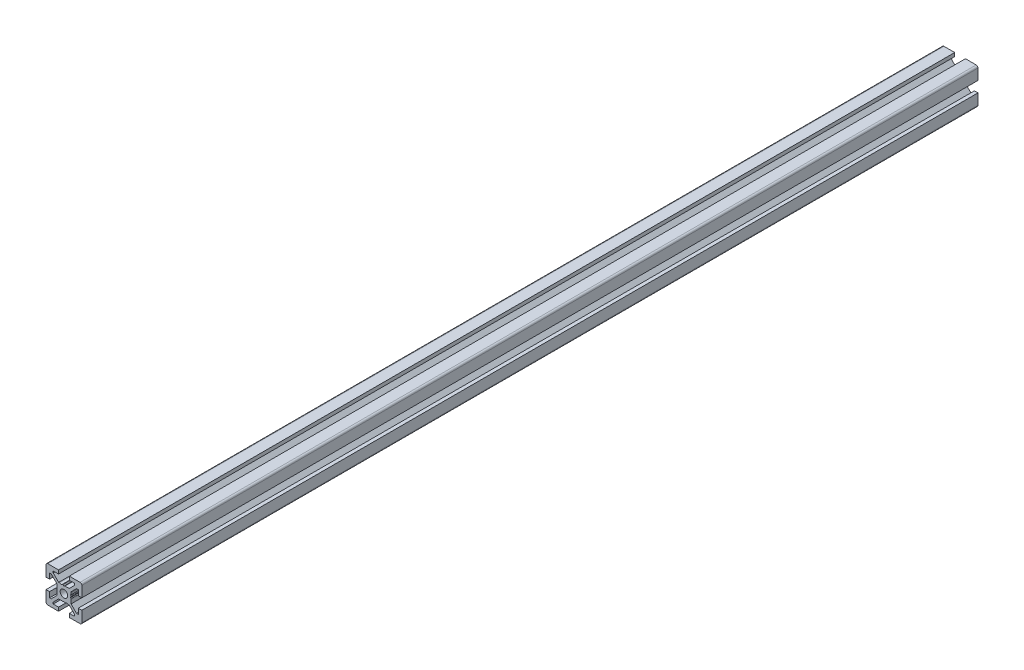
ISO-10303-21;
HEADER;
FILE_DESCRIPTION(('STEP AP214'),'2;1');
FILE_NAME('part.step','',(''),(''),'','','');
FILE_SCHEMA(('AUTOMOTIVE_DESIGN { 1 0 10303 214 1 1 1 1 }'));
ENDSEC;
DATA;
#1=APPLICATION_CONTEXT('core data for automotive mechanical design processes');
#2=APPLICATION_PROTOCOL_DEFINITION('international standard','automotive_design',2000,#1);
#3=PRODUCT_CONTEXT('',#1,'mechanical');
#4=PRODUCT('Part','Part','',(#3));
#5=PRODUCT_RELATED_PRODUCT_CATEGORY('part','',(#4));
#6=PRODUCT_DEFINITION_FORMATION('','',#4);
#7=PRODUCT_DEFINITION_CONTEXT('part definition',#1,'design');
#8=PRODUCT_DEFINITION('design','',#6,#7);
#9=PRODUCT_DEFINITION_SHAPE('','',#8);
#10=(LENGTH_UNIT() NAMED_UNIT(*) SI_UNIT(.MILLI.,.METRE.));
#11=(NAMED_UNIT(*) PLANE_ANGLE_UNIT() SI_UNIT($,.RADIAN.));
#12=(NAMED_UNIT(*) SI_UNIT($,.STERADIAN.) SOLID_ANGLE_UNIT());
#13=UNCERTAINTY_MEASURE_WITH_UNIT(LENGTH_MEASURE(1.E-05),#10,'distance_accuracy_value','');
#14=(GEOMETRIC_REPRESENTATION_CONTEXT(3) GLOBAL_UNCERTAINTY_ASSIGNED_CONTEXT((#13)) GLOBAL_UNIT_ASSIGNED_CONTEXT((#10,
#11,#12)) REPRESENTATION_CONTEXT('',''));
#15=CARTESIAN_POINT('',(0.,0.,0.));
#16=DIRECTION('',(0.,0.,1.));
#17=DIRECTION('',(1.,0.,0.));
#18=AXIS2_PLACEMENT_3D('',#15,#16,#17);
#19=CARTESIAN_POINT('',(-10.,-9.,0.));
#20=DIRECTION('',(-1.,0.,0.));
#21=DIRECTION('',(0.,0.,1.));
#22=AXIS2_PLACEMENT_3D('',#19,#20,#21);
#23=PLANE('',#22);
#24=DIRECTION('',(0.,1.,0.));
#25=VECTOR('',#24,1.);
#26=CARTESIAN_POINT('',(-10.,-9.,-500.));
#27=LINE('',#26,#25);
#28=CARTESIAN_POINT('',(-10.,-9.,-500.));
#29=VERTEX_POINT('',#28);
#30=CARTESIAN_POINT('',(-10.,-3.,-500.));
#31=VERTEX_POINT('',#30);
#32=EDGE_CURVE('E557',#29,#31,#27,.T.);
#33=ORIENTED_EDGE('',*,*,#32,.F.);
#34=DIRECTION('',(0.,0.,-1.));
#35=VECTOR('',#34,1.);
#36=CARTESIAN_POINT('',(-10.,-9.,0.));
#37=LINE('',#36,#35);
#38=CARTESIAN_POINT('',(-10.,-9.,0.));
#39=VERTEX_POINT('',#38);
#40=EDGE_CURVE('E11',#39,#29,#37,.T.);
#41=ORIENTED_EDGE('',*,*,#40,.F.);
#42=DIRECTION('',(0.,1.,0.));
#43=VECTOR('',#42,1.);
#44=CARTESIAN_POINT('',(-10.,-9.,0.));
#45=LINE('',#44,#43);
#46=CARTESIAN_POINT('',(-10.,-3.,0.));
#47=VERTEX_POINT('',#46);
#48=EDGE_CURVE('E857',#39,#47,#45,.T.);
#49=ORIENTED_EDGE('',*,*,#48,.T.);
#50=DIRECTION('',(0.,0.,-1.));
#51=VECTOR('',#50,1.);
#52=CARTESIAN_POINT('',(-10.,-3.,0.));
#53=LINE('',#52,#51);
#54=EDGE_CURVE('E48',#47,#31,#53,.T.);
#55=ORIENTED_EDGE('',*,*,#54,.T.);
#56=EDGE_LOOP('',(#33,#41,#49,#55));
#57=FACE_BOUND('',#56,.T.);
#58=ADVANCED_FACE('F44',(#57),#23,.T.);
#59=CARTESIAN_POINT('',(-9.,-9.,0.));
#60=DIRECTION('',(0.,0.,-1.));
#61=DIRECTION('',(-1.,0.,0.));
#62=AXIS2_PLACEMENT_3D('',#59,#60,#61);
#63=CYLINDRICAL_SURFACE('',#62,1.);
#64=CARTESIAN_POINT('',(-9.,-9.,-500.));
#65=DIRECTION('',(0.,0.,-1.));
#66=DIRECTION('',(-1.,0.,0.));
#67=AXIS2_PLACEMENT_3D('',#64,#65,#66);
#68=CIRCLE('',#67,1.);
#69=CARTESIAN_POINT('',(-9.,-10.,-500.));
#70=VERTEX_POINT('',#69);
#71=EDGE_CURVE('E853',#70,#29,#68,.T.);
#72=ORIENTED_EDGE('',*,*,#71,.F.);
#73=DIRECTION('',(0.,0.,-1.));
#74=VECTOR('',#73,1.);
#75=CARTESIAN_POINT('',(-9.,-10.,0.));
#76=LINE('',#75,#74);
#77=CARTESIAN_POINT('',(-9.,-10.,0.));
#78=VERTEX_POINT('',#77);
#79=EDGE_CURVE('E54',#78,#70,#76,.T.);
#80=ORIENTED_EDGE('',*,*,#79,.F.);
#81=CARTESIAN_POINT('',(-9.,-9.,0.));
#82=DIRECTION('',(0.,0.,-1.));
#83=DIRECTION('',(-1.,0.,0.));
#84=AXIS2_PLACEMENT_3D('',#81,#82,#83);
#85=CIRCLE('',#84,1.);
#86=EDGE_CURVE('E545',#78,#39,#85,.T.);
#87=ORIENTED_EDGE('',*,*,#86,.T.);
#88=ORIENTED_EDGE('',*,*,#40,.T.);
#89=EDGE_LOOP('',(#72,#80,#87,#88));
#90=FACE_BOUND('',#89,.T.);
#91=ADVANCED_FACE('F1080',(#90),#63,.T.);
#92=CARTESIAN_POINT('',(-3.,-10.,0.));
#93=DIRECTION('',(0.,-1.,0.));
#94=DIRECTION('',(0.,0.,-1.));
#95=AXIS2_PLACEMENT_3D('',#92,#93,#94);
#96=PLANE('',#95);
#97=DIRECTION('',(-1.,0.,0.));
#98=VECTOR('',#97,1.);
#99=CARTESIAN_POINT('',(-3.,-10.,-500.));
#100=LINE('',#99,#98);
#101=CARTESIAN_POINT('',(-3.,-10.,-500.));
#102=VERTEX_POINT('',#101);
#103=EDGE_CURVE('E526',#102,#70,#100,.T.);
#104=ORIENTED_EDGE('',*,*,#103,.F.);
#105=DIRECTION('',(0.,0.,-1.));
#106=VECTOR('',#105,1.);
#107=CARTESIAN_POINT('',(-3.,-10.,0.));
#108=LINE('',#107,#106);
#109=CARTESIAN_POINT('',(-3.,-10.,0.));
#110=VERTEX_POINT('',#109);
#111=EDGE_CURVE('E524',#110,#102,#108,.T.);
#112=ORIENTED_EDGE('',*,*,#111,.F.);
#113=DIRECTION('',(-1.,0.,0.));
#114=VECTOR('',#113,1.);
#115=CARTESIAN_POINT('',(-3.,-10.,0.));
#116=LINE('',#115,#114);
#117=EDGE_CURVE('E528',#110,#78,#116,.T.);
#118=ORIENTED_EDGE('',*,*,#117,.T.);
#119=ORIENTED_EDGE('',*,*,#79,.T.);
#120=EDGE_LOOP('',(#104,#112,#118,#119));
#121=FACE_BOUND('',#120,.T.);
#122=ADVANCED_FACE('F525',(#121),#96,.T.);
#123=CARTESIAN_POINT('',(-3.,-8.,0.));
#124=DIRECTION('',(1.,0.,0.));
#125=DIRECTION('',(0.,0.,-1.));
#126=AXIS2_PLACEMENT_3D('',#123,#124,#125);
#127=PLANE('',#126);
#128=DIRECTION('',(0.,-1.,0.));
#129=VECTOR('',#128,1.);
#130=CARTESIAN_POINT('',(-3.,-8.,-500.));
#131=LINE('',#130,#129);
#132=CARTESIAN_POINT('',(-3.,-8.,-500.));
#133=VERTEX_POINT('',#132);
#134=EDGE_CURVE('E846',#133,#102,#131,.T.);
#135=ORIENTED_EDGE('',*,*,#134,.F.);
#136=DIRECTION('',(0.,0.,-1.));
#137=VECTOR('',#136,1.);
#138=CARTESIAN_POINT('',(-3.,-8.,0.));
#139=LINE('',#138,#137);
#140=CARTESIAN_POINT('',(-3.,-8.,0.));
#141=VERTEX_POINT('',#140);
#142=EDGE_CURVE('E534',#141,#133,#139,.T.);
#143=ORIENTED_EDGE('',*,*,#142,.F.);
#144=DIRECTION('',(0.,-1.,0.));
#145=VECTOR('',#144,1.);
#146=CARTESIAN_POINT('',(-3.,-8.,0.));
#147=LINE('',#146,#145);
#148=EDGE_CURVE('E539',#141,#110,#147,.T.);
#149=ORIENTED_EDGE('',*,*,#148,.T.);
#150=ORIENTED_EDGE('',*,*,#111,.T.);
#151=EDGE_LOOP('',(#135,#143,#149,#150));
#152=FACE_BOUND('',#151,.T.);
#153=ADVANCED_FACE('F544',(#152),#127,.T.);
#154=CARTESIAN_POINT('',(-6.,-8.,0.));
#155=DIRECTION('',(0.,1.,0.));
#156=DIRECTION('',(0.,0.,1.));
#157=AXIS2_PLACEMENT_3D('',#154,#155,#156);
#158=PLANE('',#157);
#159=DIRECTION('',(1.,0.,0.));
#160=VECTOR('',#159,1.);
#161=CARTESIAN_POINT('',(-6.,-8.,-500.));
#162=LINE('',#161,#160);
#163=CARTESIAN_POINT('',(-6.,-8.,-500.));
#164=VERTEX_POINT('',#163);
#165=EDGE_CURVE('E843',#164,#133,#162,.T.);
#166=ORIENTED_EDGE('',*,*,#165,.F.);
#167=DIRECTION('',(0.,0.,-1.));
#168=VECTOR('',#167,1.);
#169=CARTESIAN_POINT('',(-6.,-8.,0.));
#170=LINE('',#169,#168);
#171=CARTESIAN_POINT('',(-6.,-8.,0.));
#172=VERTEX_POINT('',#171);
#173=EDGE_CURVE('E861',#172,#164,#170,.T.);
#174=ORIENTED_EDGE('',*,*,#173,.F.);
#175=DIRECTION('',(1.,0.,0.));
#176=VECTOR('',#175,1.);
#177=CARTESIAN_POINT('',(-6.,-8.,0.));
#178=LINE('',#177,#176);
#179=EDGE_CURVE('E550',#172,#141,#178,.T.);
#180=ORIENTED_EDGE('',*,*,#179,.T.);
#181=ORIENTED_EDGE('',*,*,#142,.T.);
#182=EDGE_LOOP('',(#166,#174,#180,#181));
#183=FACE_BOUND('',#182,.T.);
#184=ADVANCED_FACE('F1095',(#183),#158,.T.);
#185=CARTESIAN_POINT('',(-6.,-7.06066017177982,0.));
#186=DIRECTION('',(1.,0.,0.));
#187=DIRECTION('',(0.,0.,-1.));
#188=AXIS2_PLACEMENT_3D('',#185,#186,#187);
#189=PLANE('',#188);
#190=DIRECTION('',(0.,-1.,0.));
#191=VECTOR('',#190,1.);
#192=CARTESIAN_POINT('',(-6.,-7.06066017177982,-500.));
#193=LINE('',#192,#191);
#194=CARTESIAN_POINT('',(-6.,-7.06066017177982,-500.));
#195=VERTEX_POINT('',#194);
#196=EDGE_CURVE('E842',#195,#164,#193,.T.);
#197=ORIENTED_EDGE('',*,*,#196,.F.);
#198=DIRECTION('',(0.,0.,-1.));
#199=VECTOR('',#198,1.);
#200=CARTESIAN_POINT('',(-6.,-7.06066017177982,0.));
#201=LINE('',#200,#199);
#202=CARTESIAN_POINT('',(-6.,-7.06066017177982,0.));
#203=VERTEX_POINT('',#202);
#204=EDGE_CURVE('E866',#203,#195,#201,.T.);
#205=ORIENTED_EDGE('',*,*,#204,.F.);
#206=DIRECTION('',(0.,-1.,0.));
#207=VECTOR('',#206,1.);
#208=CARTESIAN_POINT('',(-6.,-7.06066017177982,0.));
#209=LINE('',#208,#207);
#210=EDGE_CURVE('E549',#203,#172,#209,.T.);
#211=ORIENTED_EDGE('',*,*,#210,.T.);
#212=ORIENTED_EDGE('',*,*,#173,.T.);
#213=EDGE_LOOP('',(#197,#205,#211,#212));
#214=FACE_BOUND('',#213,.T.);
#215=ADVANCED_FACE('F1094',(#214),#189,.T.);
#216=CARTESIAN_POINT('',(-2.93933982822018,-4.,0.));
#217=DIRECTION('',(0.707106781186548,-0.707106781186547,0.));
#218=DIRECTION('',(0.707106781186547,0.707106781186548,0.));
#219=AXIS2_PLACEMENT_3D('',#216,#217,#218);
#220=PLANE('',#219);
#221=DIRECTION('',(-0.707106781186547,-0.707106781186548,0.));
#222=VECTOR('',#221,1.);
#223=CARTESIAN_POINT('',(-2.93933982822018,-4.,-500.));
#224=LINE('',#223,#222);
#225=CARTESIAN_POINT('',(-2.93933982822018,-4.,-500.));
#226=VERTEX_POINT('',#225);
#227=EDGE_CURVE('E837',#226,#195,#224,.T.);
#228=ORIENTED_EDGE('',*,*,#227,.F.);
#229=DIRECTION('',(0.,0.,-1.));
#230=VECTOR('',#229,1.);
#231=CARTESIAN_POINT('',(-2.93933982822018,-4.,0.));
#232=LINE('',#231,#230);
#233=CARTESIAN_POINT('',(-2.93933982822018,-4.,0.));
#234=VERTEX_POINT('',#233);
#235=EDGE_CURVE('E867',#234,#226,#232,.T.);
#236=ORIENTED_EDGE('',*,*,#235,.F.);
#237=DIRECTION('',(-0.707106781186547,-0.707106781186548,0.));
#238=VECTOR('',#237,1.);
#239=CARTESIAN_POINT('',(-2.93933982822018,-4.,0.));
#240=LINE('',#239,#238);
#241=EDGE_CURVE('E1679',#234,#203,#240,.T.);
#242=ORIENTED_EDGE('',*,*,#241,.T.);
#243=ORIENTED_EDGE('',*,*,#204,.T.);
#244=EDGE_LOOP('',(#228,#236,#242,#243));
#245=FACE_BOUND('',#244,.T.);
#246=ADVANCED_FACE('F1098',(#245),#220,.T.);
#247=CARTESIAN_POINT('',(-0.653589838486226,-4.,0.));
#248=DIRECTION('',(0.,-1.,0.));
#249=DIRECTION('',(0.,0.,-1.));
#250=AXIS2_PLACEMENT_3D('',#247,#248,#249);
#251=PLANE('',#250);
#252=DIRECTION('',(-1.,0.,0.));
#253=VECTOR('',#252,1.);
#254=CARTESIAN_POINT('',(-0.653589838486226,-4.,-500.));
#255=LINE('',#254,#253);
#256=CARTESIAN_POINT('',(-0.653589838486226,-4.,-500.));
#257=VERTEX_POINT('',#256);
#258=EDGE_CURVE('E834',#257,#226,#255,.T.);
#259=ORIENTED_EDGE('',*,*,#258,.F.);
#260=DIRECTION('',(0.,0.,-1.));
#261=VECTOR('',#260,1.);
#262=CARTESIAN_POINT('',(-0.653589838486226,-4.,0.));
#263=LINE('',#262,#261);
#264=CARTESIAN_POINT('',(-0.653589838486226,-4.,0.));
#265=VERTEX_POINT('',#264);
#266=EDGE_CURVE('E875',#265,#257,#263,.T.);
#267=ORIENTED_EDGE('',*,*,#266,.F.);
#268=DIRECTION('',(-1.,0.,0.));
#269=VECTOR('',#268,1.);
#270=CARTESIAN_POINT('',(-0.653589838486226,-4.,0.));
#271=LINE('',#270,#269);
#272=EDGE_CURVE('E1671',#265,#234,#271,.T.);
#273=ORIENTED_EDGE('',*,*,#272,.T.);
#274=ORIENTED_EDGE('',*,*,#235,.T.);
#275=EDGE_LOOP('',(#259,#267,#273,#274));
#276=FACE_BOUND('',#275,.T.);
#277=ADVANCED_FACE('F1104',(#276),#251,.T.);
#278=CARTESIAN_POINT('',(-0.653589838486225,-3.5,0.));
#279=DIRECTION('',(0.,0.,-1.));
#280=DIRECTION('',(-1.,0.,0.));
#281=AXIS2_PLACEMENT_3D('',#278,#279,#280);
#282=CYLINDRICAL_SURFACE('',#281,0.5);
#283=CARTESIAN_POINT('',(-0.653589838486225,-3.5,-500.));
#284=DIRECTION('',(0.,0.,-1.));
#285=DIRECTION('',(-1.,0.,0.));
#286=AXIS2_PLACEMENT_3D('',#283,#284,#285);
#287=CIRCLE('',#286,0.5);
#288=CARTESIAN_POINT('',(-0.403589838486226,-3.93301270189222,-500.));
#289=VERTEX_POINT('',#288);
#290=EDGE_CURVE('E826',#289,#257,#287,.T.);
#291=ORIENTED_EDGE('',*,*,#290,.F.);
#292=DIRECTION('',(0.,0.,-1.));
#293=VECTOR('',#292,1.);
#294=CARTESIAN_POINT('',(-0.403589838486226,-3.93301270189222,0.));
#295=LINE('',#294,#293);
#296=CARTESIAN_POINT('',(-0.403589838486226,-3.93301270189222,0.));
#297=VERTEX_POINT('',#296);
#298=EDGE_CURVE('E874',#297,#289,#295,.T.);
#299=ORIENTED_EDGE('',*,*,#298,.F.);
#300=CARTESIAN_POINT('',(-0.653589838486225,-3.5,0.));
#301=DIRECTION('',(0.,0.,-1.));
#302=DIRECTION('',(-1.,0.,0.));
#303=AXIS2_PLACEMENT_3D('',#300,#301,#302);
#304=CIRCLE('',#303,0.5);
#305=EDGE_CURVE('E1668',#297,#265,#304,.T.);
#306=ORIENTED_EDGE('',*,*,#305,.T.);
#307=ORIENTED_EDGE('',*,*,#266,.T.);
#308=EDGE_LOOP('',(#291,#299,#306,#307));
#309=FACE_BOUND('',#308,.T.);
#310=ADVANCED_FACE('F1110',(#309),#282,.T.);
#311=CARTESIAN_POINT('',(0.,-3.7,0.));
#312=DIRECTION('',(0.500000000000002,-0.866025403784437,0.));
#313=DIRECTION('',(0.866025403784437,0.500000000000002,0.));
#314=AXIS2_PLACEMENT_3D('',#311,#312,#313);
#315=PLANE('',#314);
#316=DIRECTION('',(-0.866025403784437,-0.500000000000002,0.));
#317=VECTOR('',#316,1.);
#318=CARTESIAN_POINT('',(0.,-3.7,-500.));
#319=LINE('',#318,#317);
#320=CARTESIAN_POINT('',(0.,-3.7,-500.));
#321=VERTEX_POINT('',#320);
#322=EDGE_CURVE('E824',#321,#289,#319,.T.);
#323=ORIENTED_EDGE('',*,*,#322,.F.);
#324=DIRECTION('',(0.,0.,-1.));
#325=VECTOR('',#324,1.);
#326=CARTESIAN_POINT('',(0.,-3.7,0.));
#327=LINE('',#326,#325);
#328=CARTESIAN_POINT('',(0.,-3.7,0.));
#329=VERTEX_POINT('',#328);
#330=EDGE_CURVE('E877',#329,#321,#327,.T.);
#331=ORIENTED_EDGE('',*,*,#330,.F.);
#332=DIRECTION('',(-0.866025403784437,-0.500000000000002,0.));
#333=VECTOR('',#332,1.);
#334=CARTESIAN_POINT('',(0.,-3.7,0.));
#335=LINE('',#334,#333);
#336=EDGE_CURVE('E1667',#329,#297,#335,.T.);
#337=ORIENTED_EDGE('',*,*,#336,.T.);
#338=ORIENTED_EDGE('',*,*,#298,.T.);
#339=EDGE_LOOP('',(#323,#331,#337,#338));
#340=FACE_BOUND('',#339,.T.);
#341=ADVANCED_FACE('F1111',(#340),#315,.T.);
#342=CARTESIAN_POINT('',(0.403589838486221,-3.93301270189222,0.));
#343=DIRECTION('',(-0.500000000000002,-0.866025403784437,0.));
#344=DIRECTION('',(0.866025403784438,-0.500000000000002,0.));
#345=AXIS2_PLACEMENT_3D('',#342,#343,#344);
#346=PLANE('',#345);
#347=DIRECTION('',(-0.866025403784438,0.500000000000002,0.));
#348=VECTOR('',#347,1.);
#349=CARTESIAN_POINT('',(0.403589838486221,-3.93301270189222,-500.));
#350=LINE('',#349,#348);
#351=CARTESIAN_POINT('',(0.403589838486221,-3.93301270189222,-500.));
#352=VERTEX_POINT('',#351);
#353=EDGE_CURVE('E821',#352,#321,#350,.T.);
#354=ORIENTED_EDGE('',*,*,#353,.F.);
#355=DIRECTION('',(0.,0.,-1.));
#356=VECTOR('',#355,1.);
#357=CARTESIAN_POINT('',(0.403589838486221,-3.93301270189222,0.));
#358=LINE('',#357,#356);
#359=CARTESIAN_POINT('',(0.403589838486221,-3.93301270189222,0.));
#360=VERTEX_POINT('',#359);
#361=EDGE_CURVE('E882',#360,#352,#358,.T.);
#362=ORIENTED_EDGE('',*,*,#361,.F.);
#363=DIRECTION('',(-0.866025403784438,0.500000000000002,0.));
#364=VECTOR('',#363,1.);
#365=CARTESIAN_POINT('',(0.403589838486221,-3.93301270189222,0.));
#366=LINE('',#365,#364);
#367=EDGE_CURVE('E1662',#360,#329,#366,.T.);
#368=ORIENTED_EDGE('',*,*,#367,.T.);
#369=ORIENTED_EDGE('',*,*,#330,.T.);
#370=EDGE_LOOP('',(#354,#362,#368,#369));
#371=FACE_BOUND('',#370,.T.);
#372=ADVANCED_FACE('F1115',(#371),#346,.T.);
#373=CARTESIAN_POINT('',(0.653589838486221,-3.5,0.));
#374=DIRECTION('',(0.,0.,-1.));
#375=DIRECTION('',(-1.,0.,0.));
#376=AXIS2_PLACEMENT_3D('',#373,#374,#375);
#377=CYLINDRICAL_SURFACE('',#376,0.5);
#378=CARTESIAN_POINT('',(0.653589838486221,-3.5,-500.));
#379=DIRECTION('',(0.,0.,-1.));
#380=DIRECTION('',(-1.,0.,0.));
#381=AXIS2_PLACEMENT_3D('',#378,#379,#380);
#382=CIRCLE('',#381,0.5);
#383=CARTESIAN_POINT('',(0.90358983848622,-3.93301270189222,-500.));
#384=VERTEX_POINT('',#383);
#385=EDGE_CURVE('E820',#384,#352,#382,.T.);
#386=ORIENTED_EDGE('',*,*,#385,.F.);
#387=DIRECTION('',(0.,0.,-1.));
#388=VECTOR('',#387,1.);
#389=CARTESIAN_POINT('',(0.90358983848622,-3.93301270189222,0.));
#390=LINE('',#389,#388);
#391=CARTESIAN_POINT('',(0.90358983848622,-3.93301270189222,0.));
#392=VERTEX_POINT('',#391);
#393=EDGE_CURVE('E881',#392,#384,#390,.T.);
#394=ORIENTED_EDGE('',*,*,#393,.F.);
#395=CARTESIAN_POINT('',(0.653589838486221,-3.5,0.));
#396=DIRECTION('',(0.,0.,-1.));
#397=DIRECTION('',(-1.,0.,0.));
#398=AXIS2_PLACEMENT_3D('',#395,#396,#397);
#399=CIRCLE('',#398,0.5);
#400=EDGE_CURVE('E1659',#392,#360,#399,.T.);
#401=ORIENTED_EDGE('',*,*,#400,.T.);
#402=ORIENTED_EDGE('',*,*,#361,.T.);
#403=EDGE_LOOP('',(#386,#394,#401,#402));
#404=FACE_BOUND('',#403,.T.);
#405=ADVANCED_FACE('F1119',(#404),#377,.T.);
#406=CARTESIAN_POINT('',(1.2188856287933,-3.75097659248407,0.));
#407=DIRECTION('',(0.500000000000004,-0.866025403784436,0.));
#408=DIRECTION('',(0.866025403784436,0.500000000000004,0.));
#409=AXIS2_PLACEMENT_3D('',#406,#407,#408);
#410=PLANE('',#409);
#411=DIRECTION('',(-0.866025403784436,-0.500000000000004,0.));
#412=VECTOR('',#411,1.);
#413=CARTESIAN_POINT('',(1.2188856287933,-3.75097659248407,-500.));
#414=LINE('',#413,#412);
#415=CARTESIAN_POINT('',(1.2188856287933,-3.75097659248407,-500.));
#416=VERTEX_POINT('',#415);
#417=EDGE_CURVE('E813',#416,#384,#414,.T.);
#418=ORIENTED_EDGE('',*,*,#417,.F.);
#419=DIRECTION('',(0.,0.,-1.));
#420=VECTOR('',#419,1.);
#421=CARTESIAN_POINT('',(1.2188856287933,-3.75097659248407,0.));
#422=LINE('',#421,#420);
#423=CARTESIAN_POINT('',(1.2188856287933,-3.75097659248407,0.));
#424=VERTEX_POINT('',#423);
#425=EDGE_CURVE('E890',#424,#416,#422,.T.);
#426=ORIENTED_EDGE('',*,*,#425,.F.);
#427=DIRECTION('',(-0.866025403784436,-0.500000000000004,0.));
#428=VECTOR('',#427,1.);
#429=CARTESIAN_POINT('',(1.2188856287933,-3.75097659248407,0.));
#430=LINE('',#429,#428);
#431=EDGE_CURVE('E1651',#424,#392,#430,.T.);
#432=ORIENTED_EDGE('',*,*,#431,.T.);
#433=ORIENTED_EDGE('',*,*,#393,.T.);
#434=EDGE_LOOP('',(#418,#426,#432,#433));
#435=FACE_BOUND('',#434,.T.);
#436=ADVANCED_FACE('F1124',(#435),#410,.T.);
#437=CARTESIAN_POINT('',(2.5,-4.,0.));
#438=DIRECTION('',(-0.190808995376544,-0.981627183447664,0.));
#439=DIRECTION('',(0.981627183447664,-0.190808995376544,0.));
#440=AXIS2_PLACEMENT_3D('',#437,#438,#439);
#441=PLANE('',#440);
#442=DIRECTION('',(-0.981627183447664,0.190808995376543,0.));
#443=VECTOR('',#442,1.);
#444=CARTESIAN_POINT('',(2.5,-4.,-500.));
#445=LINE('',#444,#443);
#446=CARTESIAN_POINT('',(2.5,-4.,-500.));
#447=VERTEX_POINT('',#446);
#448=EDGE_CURVE('E809',#447,#416,#445,.T.);
#449=ORIENTED_EDGE('',*,*,#448,.F.);
#450=DIRECTION('',(0.,0.,-1.));
#451=VECTOR('',#450,1.);
#452=CARTESIAN_POINT('',(2.5,-4.,0.));
#453=LINE('',#452,#451);
#454=CARTESIAN_POINT('',(2.5,-4.,0.));
#455=VERTEX_POINT('',#454);
#456=EDGE_CURVE('E888',#455,#447,#453,.T.);
#457=ORIENTED_EDGE('',*,*,#456,.F.);
#458=DIRECTION('',(-0.981627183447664,0.190808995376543,0.));
#459=VECTOR('',#458,1.);
#460=CARTESIAN_POINT('',(2.5,-4.,0.));
#461=LINE('',#460,#459);
#462=EDGE_CURVE('E1649',#455,#424,#461,.T.);
#463=ORIENTED_EDGE('',*,*,#462,.T.);
#464=ORIENTED_EDGE('',*,*,#425,.T.);
#465=EDGE_LOOP('',(#449,#457,#463,#464));
#466=FACE_BOUND('',#465,.T.);
#467=ADVANCED_FACE('F1127',(#466),#441,.T.);
#468=CARTESIAN_POINT('',(2.93933982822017,-4.,0.));
#469=DIRECTION('',(0.,-1.,0.));
#470=DIRECTION('',(0.,0.,-1.));
#471=AXIS2_PLACEMENT_3D('',#468,#469,#470);
#472=PLANE('',#471);
#473=DIRECTION('',(-1.,0.,0.));
#474=VECTOR('',#473,1.);
#475=CARTESIAN_POINT('',(2.93933982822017,-4.,-500.));
#476=LINE('',#475,#474);
#477=CARTESIAN_POINT('',(2.93933982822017,-4.,-500.));
#478=VERTEX_POINT('',#477);
#479=EDGE_CURVE('E804',#478,#447,#476,.T.);
#480=ORIENTED_EDGE('',*,*,#479,.F.);
#481=DIRECTION('',(0.,0.,-1.));
#482=VECTOR('',#481,1.);
#483=CARTESIAN_POINT('',(2.93933982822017,-4.,0.));
#484=LINE('',#483,#482);
#485=CARTESIAN_POINT('',(2.93933982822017,-4.,0.));
#486=VERTEX_POINT('',#485);
#487=EDGE_CURVE('E894',#486,#478,#484,.T.);
#488=ORIENTED_EDGE('',*,*,#487,.F.);
#489=DIRECTION('',(-1.,0.,0.));
#490=VECTOR('',#489,1.);
#491=CARTESIAN_POINT('',(2.93933982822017,-4.,0.));
#492=LINE('',#491,#490);
#493=EDGE_CURVE('E1646',#486,#455,#492,.T.);
#494=ORIENTED_EDGE('',*,*,#493,.T.);
#495=ORIENTED_EDGE('',*,*,#456,.T.);
#496=EDGE_LOOP('',(#480,#488,#494,#495));
#497=FACE_BOUND('',#496,.T.);
#498=ADVANCED_FACE('F1133',(#497),#472,.T.);
#499=CARTESIAN_POINT('',(6.,-7.06066017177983,0.));
#500=DIRECTION('',(-0.707106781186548,-0.707106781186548,0.));
#501=DIRECTION('',(0.707106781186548,-0.707106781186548,0.));
#502=AXIS2_PLACEMENT_3D('',#499,#500,#501);
#503=PLANE('',#502);
#504=DIRECTION('',(-0.707106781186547,0.707106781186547,0.));
#505=VECTOR('',#504,1.);
#506=CARTESIAN_POINT('',(6.,-7.06066017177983,-500.));
#507=LINE('',#506,#505);
#508=CARTESIAN_POINT('',(6.,-7.06066017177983,-500.));
#509=VERTEX_POINT('',#508);
#510=EDGE_CURVE('E803',#509,#478,#507,.T.);
#511=ORIENTED_EDGE('',*,*,#510,.F.);
#512=DIRECTION('',(0.,0.,-1.));
#513=VECTOR('',#512,1.);
#514=CARTESIAN_POINT('',(6.,-7.06066017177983,0.));
#515=LINE('',#514,#513);
#516=CARTESIAN_POINT('',(6.,-7.06066017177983,0.));
#517=VERTEX_POINT('',#516);
#518=EDGE_CURVE('E897',#517,#509,#515,.T.);
#519=ORIENTED_EDGE('',*,*,#518,.F.);
#520=DIRECTION('',(-0.707106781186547,0.707106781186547,0.));
#521=VECTOR('',#520,1.);
#522=CARTESIAN_POINT('',(6.,-7.06066017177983,0.));
#523=LINE('',#522,#521);
#524=EDGE_CURVE('E1645',#517,#486,#523,.T.);
#525=ORIENTED_EDGE('',*,*,#524,.T.);
#526=ORIENTED_EDGE('',*,*,#487,.T.);
#527=EDGE_LOOP('',(#511,#519,#525,#526));
#528=FACE_BOUND('',#527,.T.);
#529=ADVANCED_FACE('F1134',(#528),#503,.T.);
#530=CARTESIAN_POINT('',(6.,-8.,0.));
#531=DIRECTION('',(-1.,0.,0.));
#532=DIRECTION('',(0.,0.,1.));
#533=AXIS2_PLACEMENT_3D('',#530,#531,#532);
#534=PLANE('',#533);
#535=DIRECTION('',(0.,1.,0.));
#536=VECTOR('',#535,1.);
#537=CARTESIAN_POINT('',(6.,-8.,-500.));
#538=LINE('',#537,#536);
#539=CARTESIAN_POINT('',(6.,-8.,-500.));
#540=VERTEX_POINT('',#539);
#541=EDGE_CURVE('E797',#540,#509,#538,.T.);
#542=ORIENTED_EDGE('',*,*,#541,.F.);
#543=DIRECTION('',(0.,0.,-1.));
#544=VECTOR('',#543,1.);
#545=CARTESIAN_POINT('',(6.,-8.,0.));
#546=LINE('',#545,#544);
#547=CARTESIAN_POINT('',(6.,-8.,0.));
#548=VERTEX_POINT('',#547);
#549=EDGE_CURVE('E899',#548,#540,#546,.T.);
#550=ORIENTED_EDGE('',*,*,#549,.F.);
#551=DIRECTION('',(0.,1.,0.));
#552=VECTOR('',#551,1.);
#553=CARTESIAN_POINT('',(6.,-8.,0.));
#554=LINE('',#553,#552);
#555=EDGE_CURVE('E1638',#548,#517,#554,.T.);
#556=ORIENTED_EDGE('',*,*,#555,.T.);
#557=ORIENTED_EDGE('',*,*,#518,.T.);
#558=EDGE_LOOP('',(#542,#550,#556,#557));
#559=FACE_BOUND('',#558,.T.);
#560=ADVANCED_FACE('F1139',(#559),#534,.T.);
#561=CARTESIAN_POINT('',(3.,-8.,0.));
#562=DIRECTION('',(0.,1.,0.));
#563=DIRECTION('',(0.,0.,1.));
#564=AXIS2_PLACEMENT_3D('',#561,#562,#563);
#565=PLANE('',#564);
#566=DIRECTION('',(1.,0.,0.));
#567=VECTOR('',#566,1.);
#568=CARTESIAN_POINT('',(3.,-8.,-500.));
#569=LINE('',#568,#567);
#570=CARTESIAN_POINT('',(3.,-8.,-500.));
#571=VERTEX_POINT('',#570);
#572=EDGE_CURVE('E794',#571,#540,#569,.T.);
#573=ORIENTED_EDGE('',*,*,#572,.F.);
#574=DIRECTION('',(0.,0.,-1.));
#575=VECTOR('',#574,1.);
#576=CARTESIAN_POINT('',(3.,-8.,0.));
#577=LINE('',#576,#575);
#578=CARTESIAN_POINT('',(3.,-8.,0.));
#579=VERTEX_POINT('',#578);
#580=EDGE_CURVE('E905',#579,#571,#577,.T.);
#581=ORIENTED_EDGE('',*,*,#580,.F.);
#582=DIRECTION('',(1.,0.,0.));
#583=VECTOR('',#582,1.);
#584=CARTESIAN_POINT('',(3.,-8.,0.));
#585=LINE('',#584,#583);
#586=EDGE_CURVE('E1634',#579,#548,#585,.T.);
#587=ORIENTED_EDGE('',*,*,#586,.T.);
#588=ORIENTED_EDGE('',*,*,#549,.T.);
#589=EDGE_LOOP('',(#573,#581,#587,#588));
#590=FACE_BOUND('',#589,.T.);
#591=ADVANCED_FACE('F1143',(#590),#565,.T.);
#592=CARTESIAN_POINT('',(3.,-10.,0.));
#593=DIRECTION('',(-1.,0.,0.));
#594=DIRECTION('',(0.,0.,1.));
#595=AXIS2_PLACEMENT_3D('',#592,#593,#594);
#596=PLANE('',#595);
#597=DIRECTION('',(0.,1.,0.));
#598=VECTOR('',#597,1.);
#599=CARTESIAN_POINT('',(3.,-10.,-500.));
#600=LINE('',#599,#598);
#601=CARTESIAN_POINT('',(3.,-10.,-500.));
#602=VERTEX_POINT('',#601);
#603=EDGE_CURVE('E789',#602,#571,#600,.T.);
#604=ORIENTED_EDGE('',*,*,#603,.F.);
#605=DIRECTION('',(0.,0.,-1.));
#606=VECTOR('',#605,1.);
#607=CARTESIAN_POINT('',(3.,-10.,0.));
#608=LINE('',#607,#606);
#609=CARTESIAN_POINT('',(3.,-10.,0.));
#610=VERTEX_POINT('',#609);
#611=EDGE_CURVE('E903',#610,#602,#608,.T.);
#612=ORIENTED_EDGE('',*,*,#611,.F.);
#613=DIRECTION('',(0.,1.,0.));
#614=VECTOR('',#613,1.);
#615=CARTESIAN_POINT('',(3.,-10.,0.));
#616=LINE('',#615,#614);
#617=EDGE_CURVE('E1629',#610,#579,#616,.T.);
#618=ORIENTED_EDGE('',*,*,#617,.T.);
#619=ORIENTED_EDGE('',*,*,#580,.T.);
#620=EDGE_LOOP('',(#604,#612,#618,#619));
#621=FACE_BOUND('',#620,.T.);
#622=ADVANCED_FACE('F1150',(#621),#596,.T.);
#623=CARTESIAN_POINT('',(9.,-10.,0.));
#624=DIRECTION('',(0.,-1.,0.));
#625=DIRECTION('',(0.,0.,-1.));
#626=AXIS2_PLACEMENT_3D('',#623,#624,#625);
#627=PLANE('',#626);
#628=DIRECTION('',(-1.,0.,0.));
#629=VECTOR('',#628,1.);
#630=CARTESIAN_POINT('',(9.,-10.,-500.));
#631=LINE('',#630,#629);
#632=CARTESIAN_POINT('',(9.,-10.,-500.));
#633=VERTEX_POINT('',#632);
#634=EDGE_CURVE('E785',#633,#602,#631,.T.);
#635=ORIENTED_EDGE('',*,*,#634,.F.);
#636=DIRECTION('',(0.,0.,-1.));
#637=VECTOR('',#636,1.);
#638=CARTESIAN_POINT('',(9.,-10.,0.));
#639=LINE('',#638,#637);
#640=CARTESIAN_POINT('',(9.,-10.,0.));
#641=VERTEX_POINT('',#640);
#642=EDGE_CURVE('E909',#641,#633,#639,.T.);
#643=ORIENTED_EDGE('',*,*,#642,.F.);
#644=DIRECTION('',(-1.,0.,0.));
#645=VECTOR('',#644,1.);
#646=CARTESIAN_POINT('',(9.,-10.,0.));
#647=LINE('',#646,#645);
#648=EDGE_CURVE('E1628',#641,#610,#647,.T.);
#649=ORIENTED_EDGE('',*,*,#648,.T.);
#650=ORIENTED_EDGE('',*,*,#611,.T.);
#651=EDGE_LOOP('',(#635,#643,#649,#650));
#652=FACE_BOUND('',#651,.T.);
#653=ADVANCED_FACE('F1151',(#652),#627,.T.);
#654=CARTESIAN_POINT('',(9.,-9.,0.));
#655=DIRECTION('',(0.,0.,-1.));
#656=DIRECTION('',(-1.,0.,0.));
#657=AXIS2_PLACEMENT_3D('',#654,#655,#656);
#658=CYLINDRICAL_SURFACE('',#657,1.);
#659=CARTESIAN_POINT('',(9.,-9.,-500.));
#660=DIRECTION('',(0.,0.,-1.));
#661=DIRECTION('',(-1.,0.,0.));
#662=AXIS2_PLACEMENT_3D('',#659,#660,#661);
#663=CIRCLE('',#662,1.);
#664=CARTESIAN_POINT('',(10.,-9.,-500.));
#665=VERTEX_POINT('',#664);
#666=EDGE_CURVE('E781',#665,#633,#663,.T.);
#667=ORIENTED_EDGE('',*,*,#666,.F.);
#668=DIRECTION('',(0.,0.,-1.));
#669=VECTOR('',#668,1.);
#670=CARTESIAN_POINT('',(10.,-9.,0.));
#671=LINE('',#670,#669);
#672=CARTESIAN_POINT('',(10.,-9.,0.));
#673=VERTEX_POINT('',#672);
#674=EDGE_CURVE('E913',#673,#665,#671,.T.);
#675=ORIENTED_EDGE('',*,*,#674,.F.);
#676=CARTESIAN_POINT('',(9.,-9.,0.));
#677=DIRECTION('',(0.,0.,-1.));
#678=DIRECTION('',(-1.,0.,0.));
#679=AXIS2_PLACEMENT_3D('',#676,#677,#678);
#680=CIRCLE('',#679,1.);
#681=EDGE_CURVE('E1622',#673,#641,#680,.T.);
#682=ORIENTED_EDGE('',*,*,#681,.T.);
#683=ORIENTED_EDGE('',*,*,#642,.T.);
#684=EDGE_LOOP('',(#667,#675,#682,#683));
#685=FACE_BOUND('',#684,.T.);
#686=ADVANCED_FACE('F1154',(#685),#658,.T.);
#687=CARTESIAN_POINT('',(10.,-3.,0.));
#688=DIRECTION('',(1.,0.,0.));
#689=DIRECTION('',(0.,0.,-1.));
#690=AXIS2_PLACEMENT_3D('',#687,#688,#689);
#691=PLANE('',#690);
#692=DIRECTION('',(0.,-1.,0.));
#693=VECTOR('',#692,1.);
#694=CARTESIAN_POINT('',(10.,-3.,-500.));
#695=LINE('',#694,#693);
#696=CARTESIAN_POINT('',(10.,-3.,-500.));
#697=VERTEX_POINT('',#696);
#698=EDGE_CURVE('E780',#697,#665,#695,.T.);
#699=ORIENTED_EDGE('',*,*,#698,.F.);
#700=DIRECTION('',(0.,0.,-1.));
#701=VECTOR('',#700,1.);
#702=CARTESIAN_POINT('',(10.,-3.,0.));
#703=LINE('',#702,#701);
#704=CARTESIAN_POINT('',(10.,-3.,0.));
#705=VERTEX_POINT('',#704);
#706=EDGE_CURVE('E915',#705,#697,#703,.T.);
#707=ORIENTED_EDGE('',*,*,#706,.F.);
#708=DIRECTION('',(0.,-1.,0.));
#709=VECTOR('',#708,1.);
#710=CARTESIAN_POINT('',(10.,-3.,0.));
#711=LINE('',#710,#709);
#712=EDGE_CURVE('E1619',#705,#673,#711,.T.);
#713=ORIENTED_EDGE('',*,*,#712,.T.);
#714=ORIENTED_EDGE('',*,*,#674,.T.);
#715=EDGE_LOOP('',(#699,#707,#713,#714));
#716=FACE_BOUND('',#715,.T.);
#717=ADVANCED_FACE('F1156',(#716),#691,.T.);
#718=CARTESIAN_POINT('',(8.,-3.,0.));
#719=DIRECTION('',(0.,1.,0.));
#720=DIRECTION('',(0.,0.,1.));
#721=AXIS2_PLACEMENT_3D('',#718,#719,#720);
#722=PLANE('',#721);
#723=DIRECTION('',(1.,0.,0.));
#724=VECTOR('',#723,1.);
#725=CARTESIAN_POINT('',(8.,-3.,-500.));
#726=LINE('',#725,#724);
#727=CARTESIAN_POINT('',(8.,-3.,-500.));
#728=VERTEX_POINT('',#727);
#729=EDGE_CURVE('E774',#728,#697,#726,.T.);
#730=ORIENTED_EDGE('',*,*,#729,.F.);
#731=DIRECTION('',(0.,0.,-1.));
#732=VECTOR('',#731,1.);
#733=CARTESIAN_POINT('',(8.,-3.,0.));
#734=LINE('',#733,#732);
#735=CARTESIAN_POINT('',(8.,-3.,0.));
#736=VERTEX_POINT('',#735);
#737=EDGE_CURVE('E920',#736,#728,#734,.T.);
#738=ORIENTED_EDGE('',*,*,#737,.F.);
#739=DIRECTION('',(1.,0.,0.));
#740=VECTOR('',#739,1.);
#741=CARTESIAN_POINT('',(8.,-3.,0.));
#742=LINE('',#741,#740);
#743=EDGE_CURVE('E1614',#736,#705,#742,.T.);
#744=ORIENTED_EDGE('',*,*,#743,.T.);
#745=ORIENTED_EDGE('',*,*,#706,.T.);
#746=EDGE_LOOP('',(#730,#738,#744,#745));
#747=FACE_BOUND('',#746,.T.);
#748=ADVANCED_FACE('F1164',(#747),#722,.T.);
#749=CARTESIAN_POINT('',(8.,-6.,0.));
#750=DIRECTION('',(-1.,0.,0.));
#751=DIRECTION('',(0.,0.,1.));
#752=AXIS2_PLACEMENT_3D('',#749,#750,#751);
#753=PLANE('',#752);
#754=DIRECTION('',(0.,1.,0.));
#755=VECTOR('',#754,1.);
#756=CARTESIAN_POINT('',(8.,-6.,-500.));
#757=LINE('',#756,#755);
#758=CARTESIAN_POINT('',(8.,-6.,-500.));
#759=VERTEX_POINT('',#758);
#760=EDGE_CURVE('E768',#759,#728,#757,.T.);
#761=ORIENTED_EDGE('',*,*,#760,.F.);
#762=DIRECTION('',(0.,0.,-1.));
#763=VECTOR('',#762,1.);
#764=CARTESIAN_POINT('',(8.,-6.,0.));
#765=LINE('',#764,#763);
#766=CARTESIAN_POINT('',(8.,-6.,0.));
#767=VERTEX_POINT('',#766);
#768=EDGE_CURVE('E917',#767,#759,#765,.T.);
#769=ORIENTED_EDGE('',*,*,#768,.F.);
#770=DIRECTION('',(0.,1.,0.));
#771=VECTOR('',#770,1.);
#772=CARTESIAN_POINT('',(8.,-6.,0.));
#773=LINE('',#772,#771);
#774=EDGE_CURVE('E1610',#767,#736,#773,.T.);
#775=ORIENTED_EDGE('',*,*,#774,.T.);
#776=ORIENTED_EDGE('',*,*,#737,.T.);
#777=EDGE_LOOP('',(#761,#769,#775,#776));
#778=FACE_BOUND('',#777,.T.);
#779=ADVANCED_FACE('F1167',(#778),#753,.T.);
#780=CARTESIAN_POINT('',(7.06066017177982,-6.,0.));
#781=DIRECTION('',(0.,1.,0.));
#782=DIRECTION('',(0.,0.,1.));
#783=AXIS2_PLACEMENT_3D('',#780,#781,#782);
#784=PLANE('',#783);
#785=DIRECTION('',(1.,0.,0.));
#786=VECTOR('',#785,1.);
#787=CARTESIAN_POINT('',(7.06066017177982,-6.,-500.));
#788=LINE('',#787,#786);
#789=CARTESIAN_POINT('',(7.06066017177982,-6.,-500.));
#790=VERTEX_POINT('',#789);
#791=EDGE_CURVE('E764',#790,#759,#788,.T.);
#792=ORIENTED_EDGE('',*,*,#791,.F.);
#793=DIRECTION('',(0.,0.,-1.));
#794=VECTOR('',#793,1.);
#795=CARTESIAN_POINT('',(7.06066017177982,-6.,0.));
#796=LINE('',#795,#794);
#797=CARTESIAN_POINT('',(7.06066017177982,-6.,0.));
#798=VERTEX_POINT('',#797);
#799=EDGE_CURVE('E923',#798,#790,#796,.T.);
#800=ORIENTED_EDGE('',*,*,#799,.F.);
#801=DIRECTION('',(1.,0.,0.));
#802=VECTOR('',#801,1.);
#803=CARTESIAN_POINT('',(7.06066017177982,-6.,0.));
#804=LINE('',#803,#802);
#805=EDGE_CURVE('E1606',#798,#767,#804,.T.);
#806=ORIENTED_EDGE('',*,*,#805,.T.);
#807=ORIENTED_EDGE('',*,*,#768,.T.);
#808=EDGE_LOOP('',(#792,#800,#806,#807));
#809=FACE_BOUND('',#808,.T.);
#810=ADVANCED_FACE('F1172',(#809),#784,.T.);
#811=CARTESIAN_POINT('',(4.,-2.93933982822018,0.));
#812=DIRECTION('',(0.707106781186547,0.707106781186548,0.));
#813=DIRECTION('',(-0.707106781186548,0.707106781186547,0.));
#814=AXIS2_PLACEMENT_3D('',#811,#812,#813);
#815=PLANE('',#814);
#816=DIRECTION('',(0.707106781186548,-0.707106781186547,0.));
#817=VECTOR('',#816,1.);
#818=CARTESIAN_POINT('',(4.,-2.93933982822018,-500.));
#819=LINE('',#818,#817);
#820=CARTESIAN_POINT('',(4.,-2.93933982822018,-500.));
#821=VERTEX_POINT('',#820);
#822=EDGE_CURVE('E761',#821,#790,#819,.T.);
#823=ORIENTED_EDGE('',*,*,#822,.F.);
#824=DIRECTION('',(0.,0.,-1.));
#825=VECTOR('',#824,1.);
#826=CARTESIAN_POINT('',(4.,-2.93933982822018,0.));
#827=LINE('',#826,#825);
#828=CARTESIAN_POINT('',(4.,-2.93933982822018,0.));
#829=VERTEX_POINT('',#828);
#830=EDGE_CURVE('E926',#829,#821,#827,.T.);
#831=ORIENTED_EDGE('',*,*,#830,.F.);
#832=DIRECTION('',(0.707106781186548,-0.707106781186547,0.));
#833=VECTOR('',#832,1.);
#834=CARTESIAN_POINT('',(4.,-2.93933982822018,0.));
#835=LINE('',#834,#833);
#836=EDGE_CURVE('E1605',#829,#798,#835,.T.);
#837=ORIENTED_EDGE('',*,*,#836,.T.);
#838=ORIENTED_EDGE('',*,*,#799,.T.);
#839=EDGE_LOOP('',(#823,#831,#837,#838));
#840=FACE_BOUND('',#839,.T.);
#841=ADVANCED_FACE('F1173',(#840),#815,.T.);
#842=CARTESIAN_POINT('',(4.,-0.653589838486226,0.));
#843=DIRECTION('',(1.,0.,0.));
#844=DIRECTION('',(0.,0.,-1.));
#845=AXIS2_PLACEMENT_3D('',#842,#843,#844);
#846=PLANE('',#845);
#847=DIRECTION('',(0.,-1.,0.));
#848=VECTOR('',#847,1.);
#849=CARTESIAN_POINT('',(4.,-0.653589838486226,-500.));
#850=LINE('',#849,#848);
#851=CARTESIAN_POINT('',(4.,-0.653589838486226,-500.));
#852=VERTEX_POINT('',#851);
#853=EDGE_CURVE('E760',#852,#821,#850,.T.);
#854=ORIENTED_EDGE('',*,*,#853,.F.);
#855=DIRECTION('',(0.,0.,-1.));
#856=VECTOR('',#855,1.);
#857=CARTESIAN_POINT('',(4.,-0.653589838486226,0.));
#858=LINE('',#857,#856);
#859=CARTESIAN_POINT('',(4.,-0.653589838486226,0.));
#860=VERTEX_POINT('',#859);
#861=EDGE_CURVE('E927',#860,#852,#858,.T.);
#862=ORIENTED_EDGE('',*,*,#861,.F.);
#863=DIRECTION('',(0.,-1.,0.));
#864=VECTOR('',#863,1.);
#865=CARTESIAN_POINT('',(4.,-0.653589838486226,0.));
#866=LINE('',#865,#864);
#867=EDGE_CURVE('E1599',#860,#829,#866,.T.);
#868=ORIENTED_EDGE('',*,*,#867,.T.);
#869=ORIENTED_EDGE('',*,*,#830,.T.);
#870=EDGE_LOOP('',(#854,#862,#868,#869));
#871=FACE_BOUND('',#870,.T.);
#872=ADVANCED_FACE('F1176',(#871),#846,.T.);
#873=CARTESIAN_POINT('',(3.5,-0.653589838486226,0.));
#874=DIRECTION('',(0.,0.,-1.));
#875=DIRECTION('',(-1.,0.,0.));
#876=AXIS2_PLACEMENT_3D('',#873,#874,#875);
#877=CYLINDRICAL_SURFACE('',#876,0.5);
#878=CARTESIAN_POINT('',(3.5,-0.653589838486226,-500.));
#879=DIRECTION('',(0.,0.,-1.));
#880=DIRECTION('',(-1.,0.,0.));
#881=AXIS2_PLACEMENT_3D('',#878,#879,#880);
#882=CIRCLE('',#881,0.5);
#883=CARTESIAN_POINT('',(3.93301270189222,-0.403589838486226,-500.));
#884=VERTEX_POINT('',#883);
#885=EDGE_CURVE('E751',#884,#852,#882,.T.);
#886=ORIENTED_EDGE('',*,*,#885,.F.);
#887=DIRECTION('',(0.,0.,-1.));
#888=VECTOR('',#887,1.);
#889=CARTESIAN_POINT('',(3.93301270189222,-0.403589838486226,0.));
#890=LINE('',#889,#888);
#891=CARTESIAN_POINT('',(3.93301270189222,-0.403589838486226,0.));
#892=VERTEX_POINT('',#891);
#893=EDGE_CURVE('E935',#892,#884,#890,.T.);
#894=ORIENTED_EDGE('',*,*,#893,.F.);
#895=CARTESIAN_POINT('',(3.5,-0.653589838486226,0.));
#896=DIRECTION('',(0.,0.,-1.));
#897=DIRECTION('',(-1.,0.,0.));
#898=AXIS2_PLACEMENT_3D('',#895,#896,#897);
#899=CIRCLE('',#898,0.5);
#900=EDGE_CURVE('E1593',#892,#860,#899,.T.);
#901=ORIENTED_EDGE('',*,*,#900,.T.);
#902=ORIENTED_EDGE('',*,*,#861,.T.);
#903=EDGE_LOOP('',(#886,#894,#901,#902));
#904=FACE_BOUND('',#903,.T.);
#905=ADVANCED_FACE('F1184',(#904),#877,.T.);
#906=CARTESIAN_POINT('',(3.7,0.,0.));
#907=DIRECTION('',(0.866025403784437,0.500000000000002,0.));
#908=DIRECTION('',(-0.500000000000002,0.866025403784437,0.));
#909=AXIS2_PLACEMENT_3D('',#906,#907,#908);
#910=PLANE('',#909);
#911=DIRECTION('',(0.500000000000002,-0.866025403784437,0.));
#912=VECTOR('',#911,1.);
#913=CARTESIAN_POINT('',(3.7,0.,-500.));
#914=LINE('',#913,#912);
#915=CARTESIAN_POINT('',(3.7,0.,-500.));
#916=VERTEX_POINT('',#915);
#917=EDGE_CURVE('E750',#916,#884,#914,.T.);
#918=ORIENTED_EDGE('',*,*,#917,.F.);
#919=DIRECTION('',(0.,0.,-1.));
#920=VECTOR('',#919,1.);
#921=CARTESIAN_POINT('',(3.7,0.,0.));
#922=LINE('',#921,#920);
#923=CARTESIAN_POINT('',(3.7,0.,0.));
#924=VERTEX_POINT('',#923);
#925=EDGE_CURVE('E934',#924,#916,#922,.T.);
#926=ORIENTED_EDGE('',*,*,#925,.F.);
#927=DIRECTION('',(0.500000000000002,-0.866025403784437,0.));
#928=VECTOR('',#927,1.);
#929=CARTESIAN_POINT('',(3.7,0.,0.));
#930=LINE('',#929,#928);
#931=EDGE_CURVE('E1589',#924,#892,#930,.T.);
#932=ORIENTED_EDGE('',*,*,#931,.T.);
#933=ORIENTED_EDGE('',*,*,#893,.T.);
#934=EDGE_LOOP('',(#918,#926,#932,#933));
#935=FACE_BOUND('',#934,.T.);
#936=ADVANCED_FACE('F1187',(#935),#910,.T.);
#937=CARTESIAN_POINT('',(3.93301270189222,0.403589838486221,0.));
#938=DIRECTION('',(0.866025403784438,-0.500000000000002,0.));
#939=DIRECTION('',(0.500000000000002,0.866025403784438,0.));
#940=AXIS2_PLACEMENT_3D('',#937,#938,#939);
#941=PLANE('',#940);
#942=DIRECTION('',(-0.500000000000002,-0.866025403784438,0.));
#943=VECTOR('',#942,1.);
#944=CARTESIAN_POINT('',(3.93301270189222,0.403589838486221,-500.));
#945=LINE('',#944,#943);
#946=CARTESIAN_POINT('',(3.93301270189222,0.403589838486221,-500.));
#947=VERTEX_POINT('',#946);
#948=EDGE_CURVE('E745',#947,#916,#945,.T.);
#949=ORIENTED_EDGE('',*,*,#948,.F.);
#950=DIRECTION('',(0.,0.,-1.));
#951=VECTOR('',#950,1.);
#952=CARTESIAN_POINT('',(3.93301270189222,0.403589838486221,0.));
#953=LINE('',#952,#951);
#954=CARTESIAN_POINT('',(3.93301270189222,0.403589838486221,0.));
#955=VERTEX_POINT('',#954);
#956=EDGE_CURVE('E939',#955,#947,#953,.T.);
#957=ORIENTED_EDGE('',*,*,#956,.F.);
#958=DIRECTION('',(-0.500000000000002,-0.866025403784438,0.));
#959=VECTOR('',#958,1.);
#960=CARTESIAN_POINT('',(3.93301270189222,0.403589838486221,0.));
#961=LINE('',#960,#959);
#962=EDGE_CURVE('E1586',#955,#924,#961,.T.);
#963=ORIENTED_EDGE('',*,*,#962,.T.);
#964=ORIENTED_EDGE('',*,*,#925,.T.);
#965=EDGE_LOOP('',(#949,#957,#963,#964));
#966=FACE_BOUND('',#965,.T.);
#967=ADVANCED_FACE('F1193',(#966),#941,.T.);
#968=CARTESIAN_POINT('',(3.5,0.653589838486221,0.));
#969=DIRECTION('',(0.,0.,-1.));
#970=DIRECTION('',(-1.,0.,0.));
#971=AXIS2_PLACEMENT_3D('',#968,#969,#970);
#972=CYLINDRICAL_SURFACE('',#971,0.5);
#973=CARTESIAN_POINT('',(3.5,0.653589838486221,-500.));
#974=DIRECTION('',(0.,0.,-1.));
#975=DIRECTION('',(-1.,0.,0.));
#976=AXIS2_PLACEMENT_3D('',#973,#974,#975);
#977=CIRCLE('',#976,0.5);
#978=CARTESIAN_POINT('',(3.93301270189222,0.90358983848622,-500.));
#979=VERTEX_POINT('',#978);
#980=EDGE_CURVE('E741',#979,#947,#977,.T.);
#981=ORIENTED_EDGE('',*,*,#980,.F.);
#982=DIRECTION('',(0.,0.,-1.));
#983=VECTOR('',#982,1.);
#984=CARTESIAN_POINT('',(3.93301270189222,0.90358983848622,0.));
#985=LINE('',#984,#983);
#986=CARTESIAN_POINT('',(3.93301270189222,0.90358983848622,0.));
#987=VERTEX_POINT('',#986);
#988=EDGE_CURVE('E942',#987,#979,#985,.T.);
#989=ORIENTED_EDGE('',*,*,#988,.F.);
#990=CARTESIAN_POINT('',(3.5,0.653589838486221,0.));
#991=DIRECTION('',(0.,0.,-1.));
#992=DIRECTION('',(-1.,0.,0.));
#993=AXIS2_PLACEMENT_3D('',#990,#991,#992);
#994=CIRCLE('',#993,0.5);
#995=EDGE_CURVE('E1585',#987,#955,#994,.T.);
#996=ORIENTED_EDGE('',*,*,#995,.T.);
#997=ORIENTED_EDGE('',*,*,#956,.T.);
#998=EDGE_LOOP('',(#981,#989,#996,#997));
#999=FACE_BOUND('',#998,.T.);
#1000=ADVANCED_FACE('F1192',(#999),#972,.T.);
#1001=CARTESIAN_POINT('',(3.75097659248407,1.2188856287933,0.));
#1002=DIRECTION('',(0.866025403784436,0.500000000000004,0.));
#1003=DIRECTION('',(-0.500000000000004,0.866025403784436,0.));
#1004=AXIS2_PLACEMENT_3D('',#1001,#1002,#1003);
#1005=PLANE('',#1004);
#1006=DIRECTION('',(0.500000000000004,-0.866025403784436,0.));
#1007=VECTOR('',#1006,1.);
#1008=CARTESIAN_POINT('',(3.75097659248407,1.2188856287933,-500.));
#1009=LINE('',#1008,#1007);
#1010=CARTESIAN_POINT('',(3.75097659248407,1.2188856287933,-500.));
#1011=VERTEX_POINT('',#1010);
#1012=EDGE_CURVE('E740',#1011,#979,#1009,.T.);
#1013=ORIENTED_EDGE('',*,*,#1012,.F.);
#1014=DIRECTION('',(0.,0.,-1.));
#1015=VECTOR('',#1014,1.);
#1016=CARTESIAN_POINT('',(3.75097659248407,1.2188856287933,0.));
#1017=LINE('',#1016,#1015);
#1018=CARTESIAN_POINT('',(3.75097659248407,1.2188856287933,0.));
#1019=VERTEX_POINT('',#1018);
#1020=EDGE_CURVE('E941',#1019,#1011,#1017,.T.);
#1021=ORIENTED_EDGE('',*,*,#1020,.F.);
#1022=DIRECTION('',(0.500000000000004,-0.866025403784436,0.));
#1023=VECTOR('',#1022,1.);
#1024=CARTESIAN_POINT('',(3.75097659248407,1.2188856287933,0.));
#1025=LINE('',#1024,#1023);
#1026=EDGE_CURVE('E1576',#1019,#987,#1025,.T.);
#1027=ORIENTED_EDGE('',*,*,#1026,.T.);
#1028=ORIENTED_EDGE('',*,*,#988,.T.);
#1029=EDGE_LOOP('',(#1013,#1021,#1027,#1028));
#1030=FACE_BOUND('',#1029,.T.);
#1031=ADVANCED_FACE('F1197',(#1030),#1005,.T.);
#1032=CARTESIAN_POINT('',(4.,2.5,0.));
#1033=DIRECTION('',(0.981627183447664,-0.190808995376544,0.));
#1034=DIRECTION('',(0.190808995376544,0.981627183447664,0.));
#1035=AXIS2_PLACEMENT_3D('',#1032,#1033,#1034);
#1036=PLANE('',#1035);
#1037=DIRECTION('',(-0.190808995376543,-0.981627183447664,0.));
#1038=VECTOR('',#1037,1.);
#1039=CARTESIAN_POINT('',(4.,2.5,-500.));
#1040=LINE('',#1039,#1038);
#1041=CARTESIAN_POINT('',(4.,2.5,-500.));
#1042=VERTEX_POINT('',#1041);
#1043=EDGE_CURVE('E731',#1042,#1011,#1040,.T.);
#1044=ORIENTED_EDGE('',*,*,#1043,.F.);
#1045=DIRECTION('',(0.,0.,-1.));
#1046=VECTOR('',#1045,1.);
#1047=CARTESIAN_POINT('',(4.,2.5,0.));
#1048=LINE('',#1047,#1046);
#1049=CARTESIAN_POINT('',(4.,2.5,0.));
#1050=VERTEX_POINT('',#1049);
#1051=EDGE_CURVE('E947',#1050,#1042,#1048,.T.);
#1052=ORIENTED_EDGE('',*,*,#1051,.F.);
#1053=DIRECTION('',(-0.190808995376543,-0.981627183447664,0.));
#1054=VECTOR('',#1053,1.);
#1055=CARTESIAN_POINT('',(4.,2.5,0.));
#1056=LINE('',#1055,#1054);
#1057=EDGE_CURVE('E1575',#1050,#1019,#1056,.T.);
#1058=ORIENTED_EDGE('',*,*,#1057,.T.);
#1059=ORIENTED_EDGE('',*,*,#1020,.T.);
#1060=EDGE_LOOP('',(#1044,#1052,#1058,#1059));
#1061=FACE_BOUND('',#1060,.T.);
#1062=ADVANCED_FACE('F1203',(#1061),#1036,.T.);
#1063=CARTESIAN_POINT('',(4.,2.93933982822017,0.));
#1064=DIRECTION('',(1.,0.,0.));
#1065=DIRECTION('',(0.,0.,-1.));
#1066=AXIS2_PLACEMENT_3D('',#1063,#1064,#1065);
#1067=PLANE('',#1066);
#1068=DIRECTION('',(0.,-1.,0.));
#1069=VECTOR('',#1068,1.);
#1070=CARTESIAN_POINT('',(4.,2.93933982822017,-500.));
#1071=LINE('',#1070,#1069);
#1072=CARTESIAN_POINT('',(4.,2.93933982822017,-500.));
#1073=VERTEX_POINT('',#1072);
#1074=EDGE_CURVE('E728',#1073,#1042,#1071,.T.);
#1075=ORIENTED_EDGE('',*,*,#1074,.F.);
#1076=DIRECTION('',(0.,0.,-1.));
#1077=VECTOR('',#1076,1.);
#1078=CARTESIAN_POINT('',(4.,2.93933982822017,0.));
#1079=LINE('',#1078,#1077);
#1080=CARTESIAN_POINT('',(4.,2.93933982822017,0.));
#1081=VERTEX_POINT('',#1080);
#1082=EDGE_CURVE('E950',#1081,#1073,#1079,.T.);
#1083=ORIENTED_EDGE('',*,*,#1082,.F.);
#1084=DIRECTION('',(0.,-1.,0.));
#1085=VECTOR('',#1084,1.);
#1086=CARTESIAN_POINT('',(4.,2.93933982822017,0.));
#1087=LINE('',#1086,#1085);
#1088=EDGE_CURVE('E1570',#1081,#1050,#1087,.T.);
#1089=ORIENTED_EDGE('',*,*,#1088,.T.);
#1090=ORIENTED_EDGE('',*,*,#1051,.T.);
#1091=EDGE_LOOP('',(#1075,#1083,#1089,#1090));
#1092=FACE_BOUND('',#1091,.T.);
#1093=ADVANCED_FACE('F1210',(#1092),#1067,.T.);
#1094=CARTESIAN_POINT('',(7.06066017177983,6.,0.));
#1095=DIRECTION('',(0.707106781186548,-0.707106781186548,0.));
#1096=DIRECTION('',(0.707106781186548,0.707106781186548,0.));
#1097=AXIS2_PLACEMENT_3D('',#1094,#1095,#1096);
#1098=PLANE('',#1097);
#1099=DIRECTION('',(-0.707106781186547,-0.707106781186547,0.));
#1100=VECTOR('',#1099,1.);
#1101=CARTESIAN_POINT('',(7.06066017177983,6.,-500.));
#1102=LINE('',#1101,#1100);
#1103=CARTESIAN_POINT('',(7.06066017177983,6.,-500.));
#1104=VERTEX_POINT('',#1103);
#1105=EDGE_CURVE('E723',#1104,#1073,#1102,.T.);
#1106=ORIENTED_EDGE('',*,*,#1105,.F.);
#1107=DIRECTION('',(0.,0.,-1.));
#1108=VECTOR('',#1107,1.);
#1109=CARTESIAN_POINT('',(7.06066017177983,6.,0.));
#1110=LINE('',#1109,#1108);
#1111=CARTESIAN_POINT('',(7.06066017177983,6.,0.));
#1112=VERTEX_POINT('',#1111);
#1113=EDGE_CURVE('E951',#1112,#1104,#1110,.T.);
#1114=ORIENTED_EDGE('',*,*,#1113,.F.);
#1115=DIRECTION('',(-0.707106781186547,-0.707106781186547,0.));
#1116=VECTOR('',#1115,1.);
#1117=CARTESIAN_POINT('',(7.06066017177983,6.,0.));
#1118=LINE('',#1117,#1116);
#1119=EDGE_CURVE('E1566',#1112,#1081,#1118,.T.);
#1120=ORIENTED_EDGE('',*,*,#1119,.T.);
#1121=ORIENTED_EDGE('',*,*,#1082,.T.);
#1122=EDGE_LOOP('',(#1106,#1114,#1120,#1121));
#1123=FACE_BOUND('',#1122,.T.);
#1124=ADVANCED_FACE('F1212',(#1123),#1098,.T.);
#1125=CARTESIAN_POINT('',(8.,6.,0.));
#1126=DIRECTION('',(0.,-1.,0.));
#1127=DIRECTION('',(0.,0.,-1.));
#1128=AXIS2_PLACEMENT_3D('',#1125,#1126,#1127);
#1129=PLANE('',#1128);
#1130=DIRECTION('',(-1.,0.,0.));
#1131=VECTOR('',#1130,1.);
#1132=CARTESIAN_POINT('',(8.,6.,-500.));
#1133=LINE('',#1132,#1131);
#1134=CARTESIAN_POINT('',(8.,6.,-500.));
#1135=VERTEX_POINT('',#1134);
#1136=EDGE_CURVE('E722',#1135,#1104,#1133,.T.);
#1137=ORIENTED_EDGE('',*,*,#1136,.F.);
#1138=DIRECTION('',(0.,0.,-1.));
#1139=VECTOR('',#1138,1.);
#1140=CARTESIAN_POINT('',(8.,6.,0.));
#1141=LINE('',#1140,#1139);
#1142=CARTESIAN_POINT('',(8.,6.,0.));
#1143=VERTEX_POINT('',#1142);
#1144=EDGE_CURVE('E957',#1143,#1135,#1141,.T.);
#1145=ORIENTED_EDGE('',*,*,#1144,.F.);
#1146=DIRECTION('',(-1.,0.,0.));
#1147=VECTOR('',#1146,1.);
#1148=CARTESIAN_POINT('',(8.,6.,0.));
#1149=LINE('',#1148,#1147);
#1150=EDGE_CURVE('E1565',#1143,#1112,#1149,.T.);
#1151=ORIENTED_EDGE('',*,*,#1150,.T.);
#1152=ORIENTED_EDGE('',*,*,#1113,.T.);
#1153=EDGE_LOOP('',(#1137,#1145,#1151,#1152));
#1154=FACE_BOUND('',#1153,.T.);
#1155=ADVANCED_FACE('F1213',(#1154),#1129,.T.);
#1156=CARTESIAN_POINT('',(8.,3.,0.));
#1157=DIRECTION('',(-1.,0.,0.));
#1158=DIRECTION('',(0.,0.,1.));
#1159=AXIS2_PLACEMENT_3D('',#1156,#1157,#1158);
#1160=PLANE('',#1159);
#1161=DIRECTION('',(0.,1.,0.));
#1162=VECTOR('',#1161,1.);
#1163=CARTESIAN_POINT('',(8.,3.,-500.));
#1164=LINE('',#1163,#1162);
#1165=CARTESIAN_POINT('',(8.,3.,-500.));
#1166=VERTEX_POINT('',#1165);
#1167=EDGE_CURVE('E720',#1166,#1135,#1164,.T.);
#1168=ORIENTED_EDGE('',*,*,#1167,.F.);
#1169=DIRECTION('',(0.,0.,-1.));
#1170=VECTOR('',#1169,1.);
#1171=CARTESIAN_POINT('',(8.,3.,0.));
#1172=LINE('',#1171,#1170);
#1173=CARTESIAN_POINT('',(8.,3.,0.));
#1174=VERTEX_POINT('',#1173);
#1175=EDGE_CURVE('E956',#1174,#1166,#1172,.T.);
#1176=ORIENTED_EDGE('',*,*,#1175,.F.);
#1177=DIRECTION('',(0.,1.,0.));
#1178=VECTOR('',#1177,1.);
#1179=CARTESIAN_POINT('',(8.,3.,0.));
#1180=LINE('',#1179,#1178);
#1181=EDGE_CURVE('E1556',#1174,#1143,#1180,.T.);
#1182=ORIENTED_EDGE('',*,*,#1181,.T.);
#1183=ORIENTED_EDGE('',*,*,#1144,.T.);
#1184=EDGE_LOOP('',(#1168,#1176,#1182,#1183));
#1185=FACE_BOUND('',#1184,.T.);
#1186=ADVANCED_FACE('F1216',(#1185),#1160,.T.);
#1187=CARTESIAN_POINT('',(10.,3.,0.));
#1188=DIRECTION('',(0.,-1.,0.));
#1189=DIRECTION('',(0.,0.,-1.));
#1190=AXIS2_PLACEMENT_3D('',#1187,#1188,#1189);
#1191=PLANE('',#1190);
#1192=DIRECTION('',(-1.,0.,0.));
#1193=VECTOR('',#1192,1.);
#1194=CARTESIAN_POINT('',(10.,3.,-500.));
#1195=LINE('',#1194,#1193);
#1196=CARTESIAN_POINT('',(10.,3.,-500.));
#1197=VERTEX_POINT('',#1196);
#1198=EDGE_CURVE('E712',#1197,#1166,#1195,.T.);
#1199=ORIENTED_EDGE('',*,*,#1198,.F.);
#1200=DIRECTION('',(0.,0.,-1.));
#1201=VECTOR('',#1200,1.);
#1202=CARTESIAN_POINT('',(10.,3.,0.));
#1203=LINE('',#1202,#1201);
#1204=CARTESIAN_POINT('',(10.,3.,0.));
#1205=VERTEX_POINT('',#1204);
#1206=EDGE_CURVE('E962',#1205,#1197,#1203,.T.);
#1207=ORIENTED_EDGE('',*,*,#1206,.F.);
#1208=DIRECTION('',(-1.,0.,0.));
#1209=VECTOR('',#1208,1.);
#1210=CARTESIAN_POINT('',(10.,3.,0.));
#1211=LINE('',#1210,#1209);
#1212=EDGE_CURVE('E1553',#1205,#1174,#1211,.T.);
#1213=ORIENTED_EDGE('',*,*,#1212,.T.);
#1214=ORIENTED_EDGE('',*,*,#1175,.T.);
#1215=EDGE_LOOP('',(#1199,#1207,#1213,#1214));
#1216=FACE_BOUND('',#1215,.T.);
#1217=ADVANCED_FACE('F1224',(#1216),#1191,.T.);
#1218=CARTESIAN_POINT('',(10.,9.,0.));
#1219=DIRECTION('',(1.,0.,0.));
#1220=DIRECTION('',(0.,0.,-1.));
#1221=AXIS2_PLACEMENT_3D('',#1218,#1219,#1220);
#1222=PLANE('',#1221);
#1223=DIRECTION('',(0.,-1.,0.));
#1224=VECTOR('',#1223,1.);
#1225=CARTESIAN_POINT('',(10.,9.,-500.));
#1226=LINE('',#1225,#1224);
#1227=CARTESIAN_POINT('',(10.,9.,-500.));
#1228=VERTEX_POINT('',#1227);
#1229=EDGE_CURVE('E707',#1228,#1197,#1226,.T.);
#1230=ORIENTED_EDGE('',*,*,#1229,.F.);
#1231=DIRECTION('',(0.,0.,-1.));
#1232=VECTOR('',#1231,1.);
#1233=CARTESIAN_POINT('',(10.,9.,0.));
#1234=LINE('',#1233,#1232);
#1235=CARTESIAN_POINT('',(10.,9.,0.));
#1236=VERTEX_POINT('',#1235);
#1237=EDGE_CURVE('E965',#1236,#1228,#1234,.T.);
#1238=ORIENTED_EDGE('',*,*,#1237,.F.);
#1239=DIRECTION('',(0.,-1.,0.));
#1240=VECTOR('',#1239,1.);
#1241=CARTESIAN_POINT('',(10.,9.,0.));
#1242=LINE('',#1241,#1240);
#1243=EDGE_CURVE('E1548',#1236,#1205,#1242,.T.);
#1244=ORIENTED_EDGE('',*,*,#1243,.T.);
#1245=ORIENTED_EDGE('',*,*,#1206,.T.);
#1246=EDGE_LOOP('',(#1230,#1238,#1244,#1245));
#1247=FACE_BOUND('',#1246,.T.);
#1248=ADVANCED_FACE('F1230',(#1247),#1222,.T.);
#1249=CARTESIAN_POINT('',(9.,9.,0.));
#1250=DIRECTION('',(0.,0.,-1.));
#1251=DIRECTION('',(-1.,0.,0.));
#1252=AXIS2_PLACEMENT_3D('',#1249,#1250,#1251);
#1253=CYLINDRICAL_SURFACE('',#1252,1.);
#1254=CARTESIAN_POINT('',(9.,9.,-500.));
#1255=DIRECTION('',(0.,0.,-1.));
#1256=DIRECTION('',(-1.,0.,0.));
#1257=AXIS2_PLACEMENT_3D('',#1254,#1255,#1256);
#1258=CIRCLE('',#1257,1.);
#1259=CARTESIAN_POINT('',(9.,10.,-500.));
#1260=VERTEX_POINT('',#1259);
#1261=EDGE_CURVE('E704',#1260,#1228,#1258,.T.);
#1262=ORIENTED_EDGE('',*,*,#1261,.F.);
#1263=DIRECTION('',(0.,0.,-1.));
#1264=VECTOR('',#1263,1.);
#1265=CARTESIAN_POINT('',(9.,10.,0.));
#1266=LINE('',#1265,#1264);
#1267=CARTESIAN_POINT('',(9.,10.,0.));
#1268=VERTEX_POINT('',#1267);
#1269=EDGE_CURVE('E966',#1268,#1260,#1266,.T.);
#1270=ORIENTED_EDGE('',*,*,#1269,.F.);
#1271=CARTESIAN_POINT('',(9.,9.,0.));
#1272=DIRECTION('',(0.,0.,-1.));
#1273=DIRECTION('',(-1.,0.,0.));
#1274=AXIS2_PLACEMENT_3D('',#1271,#1272,#1273);
#1275=CIRCLE('',#1274,1.);
#1276=EDGE_CURVE('E1547',#1268,#1236,#1275,.T.);
#1277=ORIENTED_EDGE('',*,*,#1276,.T.);
#1278=ORIENTED_EDGE('',*,*,#1237,.T.);
#1279=EDGE_LOOP('',(#1262,#1270,#1277,#1278));
#1280=FACE_BOUND('',#1279,.T.);
#1281=ADVANCED_FACE('F1232',(#1280),#1253,.T.);
#1282=CARTESIAN_POINT('',(3.,10.,0.));
#1283=DIRECTION('',(0.,1.,0.));
#1284=DIRECTION('',(0.,0.,1.));
#1285=AXIS2_PLACEMENT_3D('',#1282,#1283,#1284);
#1286=PLANE('',#1285);
#1287=DIRECTION('',(1.,0.,0.));
#1288=VECTOR('',#1287,1.);
#1289=CARTESIAN_POINT('',(3.,10.,-500.));
#1290=LINE('',#1289,#1288);
#1291=CARTESIAN_POINT('',(3.,10.,-500.));
#1292=VERTEX_POINT('',#1291);
#1293=EDGE_CURVE('E701',#1292,#1260,#1290,.T.);
#1294=ORIENTED_EDGE('',*,*,#1293,.F.);
#1295=DIRECTION('',(0.,0.,-1.));
#1296=VECTOR('',#1295,1.);
#1297=CARTESIAN_POINT('',(3.,10.,0.));
#1298=LINE('',#1297,#1296);
#1299=CARTESIAN_POINT('',(3.,10.,0.));
#1300=VERTEX_POINT('',#1299);
#1301=EDGE_CURVE('E973',#1300,#1292,#1298,.T.);
#1302=ORIENTED_EDGE('',*,*,#1301,.F.);
#1303=DIRECTION('',(1.,0.,0.));
#1304=VECTOR('',#1303,1.);
#1305=CARTESIAN_POINT('',(3.,10.,0.));
#1306=LINE('',#1305,#1304);
#1307=EDGE_CURVE('E1545',#1300,#1268,#1306,.T.);
#1308=ORIENTED_EDGE('',*,*,#1307,.T.);
#1309=ORIENTED_EDGE('',*,*,#1269,.T.);
#1310=EDGE_LOOP('',(#1294,#1302,#1308,#1309));
#1311=FACE_BOUND('',#1310,.T.);
#1312=ADVANCED_FACE('F1233',(#1311),#1286,.T.);
#1313=CARTESIAN_POINT('',(3.,8.,0.));
#1314=DIRECTION('',(-1.,0.,0.));
#1315=DIRECTION('',(0.,0.,1.));
#1316=AXIS2_PLACEMENT_3D('',#1313,#1314,#1315);
#1317=PLANE('',#1316);
#1318=DIRECTION('',(0.,1.,0.));
#1319=VECTOR('',#1318,1.);
#1320=CARTESIAN_POINT('',(3.,8.,-500.));
#1321=LINE('',#1320,#1319);
#1322=CARTESIAN_POINT('',(3.,8.,-500.));
#1323=VERTEX_POINT('',#1322);
#1324=EDGE_CURVE('E700',#1323,#1292,#1321,.T.);
#1325=ORIENTED_EDGE('',*,*,#1324,.F.);
#1326=DIRECTION('',(0.,0.,-1.));
#1327=VECTOR('',#1326,1.);
#1328=CARTESIAN_POINT('',(3.,8.,0.));
#1329=LINE('',#1328,#1327);
#1330=CARTESIAN_POINT('',(3.,8.,0.));
#1331=VERTEX_POINT('',#1330);
#1332=EDGE_CURVE('E974',#1331,#1323,#1329,.T.);
#1333=ORIENTED_EDGE('',*,*,#1332,.F.);
#1334=DIRECTION('',(0.,1.,0.));
#1335=VECTOR('',#1334,1.);
#1336=CARTESIAN_POINT('',(3.,8.,0.));
#1337=LINE('',#1336,#1335);
#1338=EDGE_CURVE('E1537',#1331,#1300,#1337,.T.);
#1339=ORIENTED_EDGE('',*,*,#1338,.T.);
#1340=ORIENTED_EDGE('',*,*,#1301,.T.);
#1341=EDGE_LOOP('',(#1325,#1333,#1339,#1340));
#1342=FACE_BOUND('',#1341,.T.);
#1343=ADVANCED_FACE('F1238',(#1342),#1317,.T.);
#1344=CARTESIAN_POINT('',(6.,8.,0.));
#1345=DIRECTION('',(0.,-1.,0.));
#1346=DIRECTION('',(0.,0.,-1.));
#1347=AXIS2_PLACEMENT_3D('',#1344,#1345,#1346);
#1348=PLANE('',#1347);
#1349=DIRECTION('',(-1.,0.,0.));
#1350=VECTOR('',#1349,1.);
#1351=CARTESIAN_POINT('',(6.,8.,-500.));
#1352=LINE('',#1351,#1350);
#1353=CARTESIAN_POINT('',(6.,8.,-500.));
#1354=VERTEX_POINT('',#1353);
#1355=EDGE_CURVE('E691',#1354,#1323,#1352,.T.);
#1356=ORIENTED_EDGE('',*,*,#1355,.F.);
#1357=DIRECTION('',(0.,0.,-1.));
#1358=VECTOR('',#1357,1.);
#1359=CARTESIAN_POINT('',(6.,8.,0.));
#1360=LINE('',#1359,#1358);
#1361=CARTESIAN_POINT('',(6.,8.,0.));
#1362=VERTEX_POINT('',#1361);
#1363=EDGE_CURVE('E980',#1362,#1354,#1360,.T.);
#1364=ORIENTED_EDGE('',*,*,#1363,.F.);
#1365=DIRECTION('',(-1.,0.,0.));
#1366=VECTOR('',#1365,1.);
#1367=CARTESIAN_POINT('',(6.,8.,0.));
#1368=LINE('',#1367,#1366);
#1369=EDGE_CURVE('E1532',#1362,#1331,#1368,.T.);
#1370=ORIENTED_EDGE('',*,*,#1369,.T.);
#1371=ORIENTED_EDGE('',*,*,#1332,.T.);
#1372=EDGE_LOOP('',(#1356,#1364,#1370,#1371));
#1373=FACE_BOUND('',#1372,.T.);
#1374=ADVANCED_FACE('F1241',(#1373),#1348,.T.);
#1375=CARTESIAN_POINT('',(6.,7.06066017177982,0.));
#1376=DIRECTION('',(-1.,0.,0.));
#1377=DIRECTION('',(0.,0.,1.));
#1378=AXIS2_PLACEMENT_3D('',#1375,#1376,#1377);
#1379=PLANE('',#1378);
#1380=DIRECTION('',(0.,1.,0.));
#1381=VECTOR('',#1380,1.);
#1382=CARTESIAN_POINT('',(6.,7.06066017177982,-500.));
#1383=LINE('',#1382,#1381);
#1384=CARTESIAN_POINT('',(6.,7.06066017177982,-500.));
#1385=VERTEX_POINT('',#1384);
#1386=EDGE_CURVE('E688',#1385,#1354,#1383,.T.);
#1387=ORIENTED_EDGE('',*,*,#1386,.F.);
#1388=DIRECTION('',(0.,0.,-1.));
#1389=VECTOR('',#1388,1.);
#1390=CARTESIAN_POINT('',(6.,7.06066017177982,0.));
#1391=LINE('',#1390,#1389);
#1392=CARTESIAN_POINT('',(6.,7.06066017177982,0.));
#1393=VERTEX_POINT('',#1392);
#1394=EDGE_CURVE('E979',#1393,#1385,#1391,.T.);
#1395=ORIENTED_EDGE('',*,*,#1394,.F.);
#1396=DIRECTION('',(0.,1.,0.));
#1397=VECTOR('',#1396,1.);
#1398=CARTESIAN_POINT('',(6.,7.06066017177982,0.));
#1399=LINE('',#1398,#1397);
#1400=EDGE_CURVE('E1529',#1393,#1362,#1399,.T.);
#1401=ORIENTED_EDGE('',*,*,#1400,.T.);
#1402=ORIENTED_EDGE('',*,*,#1363,.T.);
#1403=EDGE_LOOP('',(#1387,#1395,#1401,#1402));
#1404=FACE_BOUND('',#1403,.T.);
#1405=ADVANCED_FACE('F1250',(#1404),#1379,.T.);
#1406=CARTESIAN_POINT('',(2.93933982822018,4.,0.));
#1407=DIRECTION('',(-0.707106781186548,0.707106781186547,0.));
#1408=DIRECTION('',(-0.707106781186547,-0.707106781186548,0.));
#1409=AXIS2_PLACEMENT_3D('',#1406,#1407,#1408);
#1410=PLANE('',#1409);
#1411=DIRECTION('',(0.707106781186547,0.707106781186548,0.));
#1412=VECTOR('',#1411,1.);
#1413=CARTESIAN_POINT('',(2.93933982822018,4.,-500.));
#1414=LINE('',#1413,#1412);
#1415=CARTESIAN_POINT('',(2.93933982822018,4.,-500.));
#1416=VERTEX_POINT('',#1415);
#1417=EDGE_CURVE('E683',#1416,#1385,#1414,.T.);
#1418=ORIENTED_EDGE('',*,*,#1417,.F.);
#1419=DIRECTION('',(0.,0.,-1.));
#1420=VECTOR('',#1419,1.);
#1421=CARTESIAN_POINT('',(2.93933982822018,4.,0.));
#1422=LINE('',#1421,#1420);
#1423=CARTESIAN_POINT('',(2.93933982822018,4.,0.));
#1424=VERTEX_POINT('',#1423);
#1425=EDGE_CURVE('E983',#1424,#1416,#1422,.T.);
#1426=ORIENTED_EDGE('',*,*,#1425,.F.);
#1427=DIRECTION('',(0.707106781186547,0.707106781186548,0.));
#1428=VECTOR('',#1427,1.);
#1429=CARTESIAN_POINT('',(2.93933982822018,4.,0.));
#1430=LINE('',#1429,#1428);
#1431=EDGE_CURVE('E1526',#1424,#1393,#1430,.T.);
#1432=ORIENTED_EDGE('',*,*,#1431,.T.);
#1433=ORIENTED_EDGE('',*,*,#1394,.T.);
#1434=EDGE_LOOP('',(#1418,#1426,#1432,#1433));
#1435=FACE_BOUND('',#1434,.T.);
#1436=ADVANCED_FACE('F1251',(#1435),#1410,.T.);
#1437=CARTESIAN_POINT('',(0.653589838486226,4.,0.));
#1438=DIRECTION('',(0.,1.,0.));
#1439=DIRECTION('',(0.,0.,1.));
#1440=AXIS2_PLACEMENT_3D('',#1437,#1438,#1439);
#1441=PLANE('',#1440);
#1442=DIRECTION('',(1.,0.,0.));
#1443=VECTOR('',#1442,1.);
#1444=CARTESIAN_POINT('',(0.653589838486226,4.,-500.));
#1445=LINE('',#1444,#1443);
#1446=CARTESIAN_POINT('',(0.653589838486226,4.,-500.));
#1447=VERTEX_POINT('',#1446);
#1448=EDGE_CURVE('E682',#1447,#1416,#1445,.T.);
#1449=ORIENTED_EDGE('',*,*,#1448,.F.);
#1450=DIRECTION('',(0.,0.,-1.));
#1451=VECTOR('',#1450,1.);
#1452=CARTESIAN_POINT('',(0.653589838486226,4.,0.));
#1453=LINE('',#1452,#1451);
#1454=CARTESIAN_POINT('',(0.653589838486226,4.,0.));
#1455=VERTEX_POINT('',#1454);
#1456=EDGE_CURVE('E986',#1455,#1447,#1453,.T.);
#1457=ORIENTED_EDGE('',*,*,#1456,.F.);
#1458=DIRECTION('',(1.,0.,0.));
#1459=VECTOR('',#1458,1.);
#1460=CARTESIAN_POINT('',(0.653589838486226,4.,0.));
#1461=LINE('',#1460,#1459);
#1462=EDGE_CURVE('E1525',#1455,#1424,#1461,.T.);
#1463=ORIENTED_EDGE('',*,*,#1462,.T.);
#1464=ORIENTED_EDGE('',*,*,#1425,.T.);
#1465=EDGE_LOOP('',(#1449,#1457,#1463,#1464));
#1466=FACE_BOUND('',#1465,.T.);
#1467=ADVANCED_FACE('F1254',(#1466),#1441,.T.);
#1468=CARTESIAN_POINT('',(0.653589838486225,3.5,0.));
#1469=DIRECTION('',(0.,0.,-1.));
#1470=DIRECTION('',(-1.,0.,0.));
#1471=AXIS2_PLACEMENT_3D('',#1468,#1469,#1470);
#1472=CYLINDRICAL_SURFACE('',#1471,0.5);
#1473=CARTESIAN_POINT('',(0.653589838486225,3.5,-500.));
#1474=DIRECTION('',(0.,0.,-1.));
#1475=DIRECTION('',(-1.,0.,0.));
#1476=AXIS2_PLACEMENT_3D('',#1473,#1474,#1475);
#1477=CIRCLE('',#1476,0.5);
#1478=CARTESIAN_POINT('',(0.403589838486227,3.93301270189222,-500.));
#1479=VERTEX_POINT('',#1478);
#1480=EDGE_CURVE('E680',#1479,#1447,#1477,.T.);
#1481=ORIENTED_EDGE('',*,*,#1480,.F.);
#1482=DIRECTION('',(0.,0.,-1.));
#1483=VECTOR('',#1482,1.);
#1484=CARTESIAN_POINT('',(0.403589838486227,3.93301270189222,0.));
#1485=LINE('',#1484,#1483);
#1486=CARTESIAN_POINT('',(0.403589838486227,3.93301270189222,0.));
#1487=VERTEX_POINT('',#1486);
#1488=EDGE_CURVE('E988',#1487,#1479,#1485,.T.);
#1489=ORIENTED_EDGE('',*,*,#1488,.F.);
#1490=CARTESIAN_POINT('',(0.653589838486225,3.5,0.));
#1491=DIRECTION('',(0.,0.,-1.));
#1492=DIRECTION('',(-1.,0.,0.));
#1493=AXIS2_PLACEMENT_3D('',#1490,#1491,#1492);
#1494=CIRCLE('',#1493,0.5);
#1495=EDGE_CURVE('E1516',#1487,#1455,#1494,.T.);
#1496=ORIENTED_EDGE('',*,*,#1495,.T.);
#1497=ORIENTED_EDGE('',*,*,#1456,.T.);
#1498=EDGE_LOOP('',(#1481,#1489,#1496,#1497));
#1499=FACE_BOUND('',#1498,.T.);
#1500=ADVANCED_FACE('F1257',(#1499),#1472,.T.);
#1501=CARTESIAN_POINT('',(0.,3.7,0.));
#1502=DIRECTION('',(-0.500000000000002,0.866025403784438,0.));
#1503=DIRECTION('',(-0.866025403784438,-0.500000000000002,0.));
#1504=AXIS2_PLACEMENT_3D('',#1501,#1502,#1503);
#1505=PLANE('',#1504);
#1506=DIRECTION('',(0.866025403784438,0.500000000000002,0.));
#1507=VECTOR('',#1506,1.);
#1508=CARTESIAN_POINT('',(0.,3.7,-500.));
#1509=LINE('',#1508,#1507);
#1510=CARTESIAN_POINT('',(0.,3.7,-500.));
#1511=VERTEX_POINT('',#1510);
#1512=EDGE_CURVE('E674',#1511,#1479,#1509,.T.);
#1513=ORIENTED_EDGE('',*,*,#1512,.F.);
#1514=DIRECTION('',(0.,0.,-1.));
#1515=VECTOR('',#1514,1.);
#1516=CARTESIAN_POINT('',(0.,3.7,0.));
#1517=LINE('',#1516,#1515);
#1518=CARTESIAN_POINT('',(0.,3.7,0.));
#1519=VERTEX_POINT('',#1518);
#1520=EDGE_CURVE('E995',#1519,#1511,#1517,.T.);
#1521=ORIENTED_EDGE('',*,*,#1520,.F.);
#1522=DIRECTION('',(0.866025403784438,0.500000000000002,0.));
#1523=VECTOR('',#1522,1.);
#1524=CARTESIAN_POINT('',(0.,3.7,0.));
#1525=LINE('',#1524,#1523);
#1526=EDGE_CURVE('E1513',#1519,#1487,#1525,.T.);
#1527=ORIENTED_EDGE('',*,*,#1526,.T.);
#1528=ORIENTED_EDGE('',*,*,#1488,.T.);
#1529=EDGE_LOOP('',(#1513,#1521,#1527,#1528));
#1530=FACE_BOUND('',#1529,.T.);
#1531=ADVANCED_FACE('F1262',(#1530),#1505,.T.);
#1532=CARTESIAN_POINT('',(-0.403589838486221,3.93301270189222,0.));
#1533=DIRECTION('',(0.500000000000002,0.866025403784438,0.));
#1534=DIRECTION('',(-0.866025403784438,0.500000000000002,0.));
#1535=AXIS2_PLACEMENT_3D('',#1532,#1533,#1534);
#1536=PLANE('',#1535);
#1537=DIRECTION('',(0.866025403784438,-0.500000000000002,0.));
#1538=VECTOR('',#1537,1.);
#1539=CARTESIAN_POINT('',(-0.403589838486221,3.93301270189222,-500.));
#1540=LINE('',#1539,#1538);
#1541=CARTESIAN_POINT('',(-0.403589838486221,3.93301270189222,-500.));
#1542=VERTEX_POINT('',#1541);
#1543=EDGE_CURVE('E666',#1542,#1511,#1540,.T.);
#1544=ORIENTED_EDGE('',*,*,#1543,.F.);
#1545=DIRECTION('',(0.,0.,-1.));
#1546=VECTOR('',#1545,1.);
#1547=CARTESIAN_POINT('',(-0.403589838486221,3.93301270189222,0.));
#1548=LINE('',#1547,#1546);
#1549=CARTESIAN_POINT('',(-0.403589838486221,3.93301270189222,0.));
#1550=VERTEX_POINT('',#1549);
#1551=EDGE_CURVE('E993',#1550,#1542,#1548,.T.);
#1552=ORIENTED_EDGE('',*,*,#1551,.F.);
#1553=DIRECTION('',(0.866025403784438,-0.500000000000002,0.));
#1554=VECTOR('',#1553,1.);
#1555=CARTESIAN_POINT('',(-0.403589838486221,3.93301270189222,0.));
#1556=LINE('',#1555,#1554);
#1557=EDGE_CURVE('E1508',#1550,#1519,#1556,.T.);
#1558=ORIENTED_EDGE('',*,*,#1557,.T.);
#1559=ORIENTED_EDGE('',*,*,#1520,.T.);
#1560=EDGE_LOOP('',(#1544,#1552,#1558,#1559));
#1561=FACE_BOUND('',#1560,.T.);
#1562=ADVANCED_FACE('F1270',(#1561),#1536,.T.);
#1563=CARTESIAN_POINT('',(-0.653589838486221,3.5,0.));
#1564=DIRECTION('',(0.,0.,-1.));
#1565=DIRECTION('',(-1.,0.,0.));
#1566=AXIS2_PLACEMENT_3D('',#1563,#1564,#1565);
#1567=CYLINDRICAL_SURFACE('',#1566,0.5);
#1568=CARTESIAN_POINT('',(-0.653589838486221,3.5,-500.));
#1569=DIRECTION('',(0.,0.,-1.));
#1570=DIRECTION('',(-1.,0.,0.));
#1571=AXIS2_PLACEMENT_3D('',#1568,#1569,#1570);
#1572=CIRCLE('',#1571,0.5);
#1573=CARTESIAN_POINT('',(-0.90358983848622,3.93301270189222,-500.));
#1574=VERTEX_POINT('',#1573);
#1575=EDGE_CURVE('E663',#1574,#1542,#1572,.T.);
#1576=ORIENTED_EDGE('',*,*,#1575,.F.);
#1577=DIRECTION('',(0.,0.,-1.));
#1578=VECTOR('',#1577,1.);
#1579=CARTESIAN_POINT('',(-0.90358983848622,3.93301270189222,0.));
#1580=LINE('',#1579,#1578);
#1581=CARTESIAN_POINT('',(-0.90358983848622,3.93301270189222,0.));
#1582=VERTEX_POINT('',#1581);
#1583=EDGE_CURVE('E999',#1582,#1574,#1580,.T.);
#1584=ORIENTED_EDGE('',*,*,#1583,.F.);
#1585=CARTESIAN_POINT('',(-0.653589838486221,3.5,0.));
#1586=DIRECTION('',(0.,0.,-1.));
#1587=DIRECTION('',(-1.,0.,0.));
#1588=AXIS2_PLACEMENT_3D('',#1585,#1586,#1587);
#1589=CIRCLE('',#1588,0.5);
#1590=EDGE_CURVE('E1507',#1582,#1550,#1589,.T.);
#1591=ORIENTED_EDGE('',*,*,#1590,.T.);
#1592=ORIENTED_EDGE('',*,*,#1551,.T.);
#1593=EDGE_LOOP('',(#1576,#1584,#1591,#1592));
#1594=FACE_BOUND('',#1593,.T.);
#1595=ADVANCED_FACE('F1272',(#1594),#1567,.T.);
#1596=CARTESIAN_POINT('',(-1.2188856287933,3.75097659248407,0.));
#1597=DIRECTION('',(-0.500000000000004,0.866025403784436,0.));
#1598=DIRECTION('',(-0.866025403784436,-0.500000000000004,0.));
#1599=AXIS2_PLACEMENT_3D('',#1596,#1597,#1598);
#1600=PLANE('',#1599);
#1601=DIRECTION('',(0.866025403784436,0.500000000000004,0.));
#1602=VECTOR('',#1601,1.);
#1603=CARTESIAN_POINT('',(-1.2188856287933,3.75097659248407,-500.));
#1604=LINE('',#1603,#1602);
#1605=CARTESIAN_POINT('',(-1.2188856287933,3.75097659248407,-500.));
#1606=VERTEX_POINT('',#1605);
#1607=EDGE_CURVE('E662',#1606,#1574,#1604,.T.);
#1608=ORIENTED_EDGE('',*,*,#1607,.F.);
#1609=DIRECTION('',(0.,0.,-1.));
#1610=VECTOR('',#1609,1.);
#1611=CARTESIAN_POINT('',(-1.2188856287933,3.75097659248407,0.));
#1612=LINE('',#1611,#1610);
#1613=CARTESIAN_POINT('',(-1.2188856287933,3.75097659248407,0.));
#1614=VERTEX_POINT('',#1613);
#1615=EDGE_CURVE('E1001',#1614,#1606,#1612,.T.);
#1616=ORIENTED_EDGE('',*,*,#1615,.F.);
#1617=DIRECTION('',(0.866025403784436,0.500000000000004,0.));
#1618=VECTOR('',#1617,1.);
#1619=CARTESIAN_POINT('',(-1.2188856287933,3.75097659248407,0.));
#1620=LINE('',#1619,#1618);
#1621=EDGE_CURVE('E1505',#1614,#1582,#1620,.T.);
#1622=ORIENTED_EDGE('',*,*,#1621,.T.);
#1623=ORIENTED_EDGE('',*,*,#1583,.T.);
#1624=EDGE_LOOP('',(#1608,#1616,#1622,#1623));
#1625=FACE_BOUND('',#1624,.T.);
#1626=ADVANCED_FACE('F1273',(#1625),#1600,.T.);
#1627=CARTESIAN_POINT('',(-2.5,4.,0.));
#1628=DIRECTION('',(0.190808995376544,0.981627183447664,0.));
#1629=DIRECTION('',(-0.981627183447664,0.190808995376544,0.));
#1630=AXIS2_PLACEMENT_3D('',#1627,#1628,#1629);
#1631=PLANE('',#1630);
#1632=DIRECTION('',(0.981627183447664,-0.190808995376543,0.));
#1633=VECTOR('',#1632,1.);
#1634=CARTESIAN_POINT('',(-2.5,4.,-500.));
#1635=LINE('',#1634,#1633);
#1636=CARTESIAN_POINT('',(-2.5,4.,-500.));
#1637=VERTEX_POINT('',#1636);
#1638=EDGE_CURVE('E660',#1637,#1606,#1635,.T.);
#1639=ORIENTED_EDGE('',*,*,#1638,.F.);
#1640=DIRECTION('',(0.,0.,-1.));
#1641=VECTOR('',#1640,1.);
#1642=CARTESIAN_POINT('',(-2.5,4.,0.));
#1643=LINE('',#1642,#1641);
#1644=CARTESIAN_POINT('',(-2.5,4.,0.));
#1645=VERTEX_POINT('',#1644);
#1646=EDGE_CURVE('E1003',#1645,#1637,#1643,.T.);
#1647=ORIENTED_EDGE('',*,*,#1646,.F.);
#1648=DIRECTION('',(0.981627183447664,-0.190808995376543,0.));
#1649=VECTOR('',#1648,1.);
#1650=CARTESIAN_POINT('',(-2.5,4.,0.));
#1651=LINE('',#1650,#1649);
#1652=EDGE_CURVE('E1499',#1645,#1614,#1651,.T.);
#1653=ORIENTED_EDGE('',*,*,#1652,.T.);
#1654=ORIENTED_EDGE('',*,*,#1615,.T.);
#1655=EDGE_LOOP('',(#1639,#1647,#1653,#1654));
#1656=FACE_BOUND('',#1655,.T.);
#1657=ADVANCED_FACE('F1278',(#1656),#1631,.T.);
#1658=CARTESIAN_POINT('',(-2.93933982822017,4.,0.));
#1659=DIRECTION('',(0.,1.,0.));
#1660=DIRECTION('',(0.,0.,1.));
#1661=AXIS2_PLACEMENT_3D('',#1658,#1659,#1660);
#1662=PLANE('',#1661);
#1663=DIRECTION('',(1.,0.,0.));
#1664=VECTOR('',#1663,1.);
#1665=CARTESIAN_POINT('',(-2.93933982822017,4.,-500.));
#1666=LINE('',#1665,#1664);
#1667=CARTESIAN_POINT('',(-2.93933982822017,4.,-500.));
#1668=VERTEX_POINT('',#1667);
#1669=EDGE_CURVE('E653',#1668,#1637,#1666,.T.);
#1670=ORIENTED_EDGE('',*,*,#1669,.F.);
#1671=DIRECTION('',(0.,0.,-1.));
#1672=VECTOR('',#1671,1.);
#1673=CARTESIAN_POINT('',(-2.93933982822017,4.,0.));
#1674=LINE('',#1673,#1672);
#1675=CARTESIAN_POINT('',(-2.93933982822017,4.,0.));
#1676=VERTEX_POINT('',#1675);
#1677=EDGE_CURVE('E1010',#1676,#1668,#1674,.T.);
#1678=ORIENTED_EDGE('',*,*,#1677,.F.);
#1679=DIRECTION('',(1.,0.,0.));
#1680=VECTOR('',#1679,1.);
#1681=CARTESIAN_POINT('',(-2.93933982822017,4.,0.));
#1682=LINE('',#1681,#1680);
#1683=EDGE_CURVE('E1491',#1676,#1645,#1682,.T.);
#1684=ORIENTED_EDGE('',*,*,#1683,.T.);
#1685=ORIENTED_EDGE('',*,*,#1646,.T.);
#1686=EDGE_LOOP('',(#1670,#1678,#1684,#1685));
#1687=FACE_BOUND('',#1686,.T.);
#1688=ADVANCED_FACE('F1281',(#1687),#1662,.T.);
#1689=CARTESIAN_POINT('',(-6.,7.06066017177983,0.));
#1690=DIRECTION('',(0.707106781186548,0.707106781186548,0.));
#1691=DIRECTION('',(-0.707106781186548,0.707106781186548,0.));
#1692=AXIS2_PLACEMENT_3D('',#1689,#1690,#1691);
#1693=PLANE('',#1692);
#1694=DIRECTION('',(0.707106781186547,-0.707106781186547,0.));
#1695=VECTOR('',#1694,1.);
#1696=CARTESIAN_POINT('',(-6.,7.06066017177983,-500.));
#1697=LINE('',#1696,#1695);
#1698=CARTESIAN_POINT('',(-6.,7.06066017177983,-500.));
#1699=VERTEX_POINT('',#1698);
#1700=EDGE_CURVE('E647',#1699,#1668,#1697,.T.);
#1701=ORIENTED_EDGE('',*,*,#1700,.F.);
#1702=DIRECTION('',(0.,0.,-1.));
#1703=VECTOR('',#1702,1.);
#1704=CARTESIAN_POINT('',(-6.,7.06066017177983,0.));
#1705=LINE('',#1704,#1703);
#1706=CARTESIAN_POINT('',(-6.,7.06066017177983,0.));
#1707=VERTEX_POINT('',#1706);
#1708=EDGE_CURVE('E1008',#1707,#1699,#1705,.T.);
#1709=ORIENTED_EDGE('',*,*,#1708,.F.);
#1710=DIRECTION('',(0.707106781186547,-0.707106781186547,0.));
#1711=VECTOR('',#1710,1.);
#1712=CARTESIAN_POINT('',(-6.,7.06066017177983,0.));
#1713=LINE('',#1712,#1711);
#1714=EDGE_CURVE('E1488',#1707,#1676,#1713,.T.);
#1715=ORIENTED_EDGE('',*,*,#1714,.T.);
#1716=ORIENTED_EDGE('',*,*,#1677,.T.);
#1717=EDGE_LOOP('',(#1701,#1709,#1715,#1716));
#1718=FACE_BOUND('',#1717,.T.);
#1719=ADVANCED_FACE('F1290',(#1718),#1693,.T.);
#1720=CARTESIAN_POINT('',(-6.,8.,0.));
#1721=DIRECTION('',(1.,0.,0.));
#1722=DIRECTION('',(0.,0.,-1.));
#1723=AXIS2_PLACEMENT_3D('',#1720,#1721,#1722);
#1724=PLANE('',#1723);
#1725=DIRECTION('',(0.,-1.,0.));
#1726=VECTOR('',#1725,1.);
#1727=CARTESIAN_POINT('',(-6.,8.,-500.));
#1728=LINE('',#1727,#1726);
#1729=CARTESIAN_POINT('',(-6.,8.,-500.));
#1730=VERTEX_POINT('',#1729);
#1731=EDGE_CURVE('E642',#1730,#1699,#1728,.T.);
#1732=ORIENTED_EDGE('',*,*,#1731,.F.);
#1733=DIRECTION('',(0.,0.,-1.));
#1734=VECTOR('',#1733,1.);
#1735=CARTESIAN_POINT('',(-6.,8.,0.));
#1736=LINE('',#1735,#1734);
#1737=CARTESIAN_POINT('',(-6.,8.,0.));
#1738=VERTEX_POINT('',#1737);
#1739=EDGE_CURVE('E1014',#1738,#1730,#1736,.T.);
#1740=ORIENTED_EDGE('',*,*,#1739,.F.);
#1741=DIRECTION('',(0.,-1.,0.));
#1742=VECTOR('',#1741,1.);
#1743=CARTESIAN_POINT('',(-6.,8.,0.));
#1744=LINE('',#1743,#1742);
#1745=EDGE_CURVE('E1487',#1738,#1707,#1744,.T.);
#1746=ORIENTED_EDGE('',*,*,#1745,.T.);
#1747=ORIENTED_EDGE('',*,*,#1708,.T.);
#1748=EDGE_LOOP('',(#1732,#1740,#1746,#1747));
#1749=FACE_BOUND('',#1748,.T.);
#1750=ADVANCED_FACE('F1291',(#1749),#1724,.T.);
#1751=CARTESIAN_POINT('',(-3.,8.,0.));
#1752=DIRECTION('',(0.,-1.,0.));
#1753=DIRECTION('',(0.,0.,-1.));
#1754=AXIS2_PLACEMENT_3D('',#1751,#1752,#1753);
#1755=PLANE('',#1754);
#1756=DIRECTION('',(-1.,0.,0.));
#1757=VECTOR('',#1756,1.);
#1758=CARTESIAN_POINT('',(-3.,8.,-500.));
#1759=LINE('',#1758,#1757);
#1760=CARTESIAN_POINT('',(-3.,8.,-500.));
#1761=VERTEX_POINT('',#1760);
#1762=EDGE_CURVE('E643',#1761,#1730,#1759,.T.);
#1763=ORIENTED_EDGE('',*,*,#1762,.F.);
#1764=DIRECTION('',(0.,0.,-1.));
#1765=VECTOR('',#1764,1.);
#1766=CARTESIAN_POINT('',(-3.,8.,0.));
#1767=LINE('',#1766,#1765);
#1768=CARTESIAN_POINT('',(-3.,8.,0.));
#1769=VERTEX_POINT('',#1768);
#1770=EDGE_CURVE('E1016',#1769,#1761,#1767,.T.);
#1771=ORIENTED_EDGE('',*,*,#1770,.F.);
#1772=DIRECTION('',(-1.,0.,0.));
#1773=VECTOR('',#1772,1.);
#1774=CARTESIAN_POINT('',(-3.,8.,0.));
#1775=LINE('',#1774,#1773);
#1776=EDGE_CURVE('E1485',#1769,#1738,#1775,.T.);
#1777=ORIENTED_EDGE('',*,*,#1776,.T.);
#1778=ORIENTED_EDGE('',*,*,#1739,.T.);
#1779=EDGE_LOOP('',(#1763,#1771,#1777,#1778));
#1780=FACE_BOUND('',#1779,.T.);
#1781=ADVANCED_FACE('F1295',(#1780),#1755,.T.);
#1782=CARTESIAN_POINT('',(-3.,10.,0.));
#1783=DIRECTION('',(1.,0.,0.));
#1784=DIRECTION('',(0.,0.,-1.));
#1785=AXIS2_PLACEMENT_3D('',#1782,#1783,#1784);
#1786=PLANE('',#1785);
#1787=DIRECTION('',(0.,-1.,0.));
#1788=VECTOR('',#1787,1.);
#1789=CARTESIAN_POINT('',(-3.,10.,-500.));
#1790=LINE('',#1789,#1788);
#1791=CARTESIAN_POINT('',(-3.,10.,-500.));
#1792=VERTEX_POINT('',#1791);
#1793=EDGE_CURVE('E637',#1792,#1761,#1790,.T.);
#1794=ORIENTED_EDGE('',*,*,#1793,.F.);
#1795=DIRECTION('',(0.,0.,-1.));
#1796=VECTOR('',#1795,1.);
#1797=CARTESIAN_POINT('',(-3.,10.,0.));
#1798=LINE('',#1797,#1796);
#1799=CARTESIAN_POINT('',(-3.,10.,0.));
#1800=VERTEX_POINT('',#1799);
#1801=EDGE_CURVE('E1018',#1800,#1792,#1798,.T.);
#1802=ORIENTED_EDGE('',*,*,#1801,.F.);
#1803=DIRECTION('',(0.,-1.,0.));
#1804=VECTOR('',#1803,1.);
#1805=CARTESIAN_POINT('',(-3.,10.,0.));
#1806=LINE('',#1805,#1804);
#1807=EDGE_CURVE('E1478',#1800,#1769,#1806,.T.);
#1808=ORIENTED_EDGE('',*,*,#1807,.T.);
#1809=ORIENTED_EDGE('',*,*,#1770,.T.);
#1810=EDGE_LOOP('',(#1794,#1802,#1808,#1809));
#1811=FACE_BOUND('',#1810,.T.);
#1812=ADVANCED_FACE('F1300',(#1811),#1786,.T.);
#1813=CARTESIAN_POINT('',(-9.,10.,0.));
#1814=DIRECTION('',(0.,1.,0.));
#1815=DIRECTION('',(0.,0.,1.));
#1816=AXIS2_PLACEMENT_3D('',#1813,#1814,#1815);
#1817=PLANE('',#1816);
#1818=DIRECTION('',(1.,0.,0.));
#1819=VECTOR('',#1818,1.);
#1820=CARTESIAN_POINT('',(-9.,10.,-500.));
#1821=LINE('',#1820,#1819);
#1822=CARTESIAN_POINT('',(-9.,10.,-500.));
#1823=VERTEX_POINT('',#1822);
#1824=EDGE_CURVE('E634',#1823,#1792,#1821,.T.);
#1825=ORIENTED_EDGE('',*,*,#1824,.F.);
#1826=DIRECTION('',(0.,0.,-1.));
#1827=VECTOR('',#1826,1.);
#1828=CARTESIAN_POINT('',(-9.,10.,0.));
#1829=LINE('',#1828,#1827);
#1830=CARTESIAN_POINT('',(-9.,10.,0.));
#1831=VERTEX_POINT('',#1830);
#1832=EDGE_CURVE('E1022',#1831,#1823,#1829,.T.);
#1833=ORIENTED_EDGE('',*,*,#1832,.F.);
#1834=DIRECTION('',(1.,0.,0.));
#1835=VECTOR('',#1834,1.);
#1836=CARTESIAN_POINT('',(-9.,10.,0.));
#1837=LINE('',#1836,#1835);
#1838=EDGE_CURVE('E1472',#1831,#1800,#1837,.T.);
#1839=ORIENTED_EDGE('',*,*,#1838,.T.);
#1840=ORIENTED_EDGE('',*,*,#1801,.T.);
#1841=EDGE_LOOP('',(#1825,#1833,#1839,#1840));
#1842=FACE_BOUND('',#1841,.T.);
#1843=ADVANCED_FACE('F1301',(#1842),#1817,.T.);
#1844=CARTESIAN_POINT('',(-9.,9.,0.));
#1845=DIRECTION('',(0.,0.,-1.));
#1846=DIRECTION('',(-1.,0.,0.));
#1847=AXIS2_PLACEMENT_3D('',#1844,#1845,#1846);
#1848=CYLINDRICAL_SURFACE('',#1847,1.);
#1849=CARTESIAN_POINT('',(-9.,9.,-500.));
#1850=DIRECTION('',(0.,0.,-1.));
#1851=DIRECTION('',(-1.,0.,0.));
#1852=AXIS2_PLACEMENT_3D('',#1849,#1850,#1851);
#1853=CIRCLE('',#1852,1.);
#1854=CARTESIAN_POINT('',(-10.,9.,-500.));
#1855=VERTEX_POINT('',#1854);
#1856=EDGE_CURVE('E626',#1855,#1823,#1853,.T.);
#1857=ORIENTED_EDGE('',*,*,#1856,.F.);
#1858=DIRECTION('',(0.,0.,-1.));
#1859=VECTOR('',#1858,1.);
#1860=CARTESIAN_POINT('',(-10.,9.,0.));
#1861=LINE('',#1860,#1859);
#1862=CARTESIAN_POINT('',(-10.,9.,0.));
#1863=VERTEX_POINT('',#1862);
#1864=EDGE_CURVE('E1024',#1863,#1855,#1861,.T.);
#1865=ORIENTED_EDGE('',*,*,#1864,.F.);
#1866=CARTESIAN_POINT('',(-9.,9.,0.));
#1867=DIRECTION('',(0.,0.,-1.));
#1868=DIRECTION('',(-1.,0.,0.));
#1869=AXIS2_PLACEMENT_3D('',#1866,#1867,#1868);
#1870=CIRCLE('',#1869,1.);
#1871=EDGE_CURVE('E1467',#1863,#1831,#1870,.T.);
#1872=ORIENTED_EDGE('',*,*,#1871,.T.);
#1873=ORIENTED_EDGE('',*,*,#1832,.T.);
#1874=EDGE_LOOP('',(#1857,#1865,#1872,#1873));
#1875=FACE_BOUND('',#1874,.T.);
#1876=ADVANCED_FACE('F1310',(#1875),#1848,.T.);
#1877=CARTESIAN_POINT('',(-10.,3.,0.));
#1878=DIRECTION('',(-1.,0.,0.));
#1879=DIRECTION('',(0.,0.,1.));
#1880=AXIS2_PLACEMENT_3D('',#1877,#1878,#1879);
#1881=PLANE('',#1880);
#1882=DIRECTION('',(0.,1.,0.));
#1883=VECTOR('',#1882,1.);
#1884=CARTESIAN_POINT('',(-10.,3.,-500.));
#1885=LINE('',#1884,#1883);
#1886=CARTESIAN_POINT('',(-10.,3.,-500.));
#1887=VERTEX_POINT('',#1886);
#1888=EDGE_CURVE('E623',#1887,#1855,#1885,.T.);
#1889=ORIENTED_EDGE('',*,*,#1888,.F.);
#1890=DIRECTION('',(0.,0.,-1.));
#1891=VECTOR('',#1890,1.);
#1892=CARTESIAN_POINT('',(-10.,3.,0.));
#1893=LINE('',#1892,#1891);
#1894=CARTESIAN_POINT('',(-10.,3.,0.));
#1895=VERTEX_POINT('',#1894);
#1896=EDGE_CURVE('E1026',#1895,#1887,#1893,.T.);
#1897=ORIENTED_EDGE('',*,*,#1896,.F.);
#1898=DIRECTION('',(0.,1.,0.));
#1899=VECTOR('',#1898,1.);
#1900=CARTESIAN_POINT('',(-10.,3.,0.));
#1901=LINE('',#1900,#1899);
#1902=EDGE_CURVE('E1468',#1895,#1863,#1901,.T.);
#1903=ORIENTED_EDGE('',*,*,#1902,.T.);
#1904=ORIENTED_EDGE('',*,*,#1864,.T.);
#1905=EDGE_LOOP('',(#1889,#1897,#1903,#1904));
#1906=FACE_BOUND('',#1905,.T.);
#1907=ADVANCED_FACE('F1311',(#1906),#1881,.T.);
#1908=CARTESIAN_POINT('',(-8.,3.,0.));
#1909=DIRECTION('',(0.,-1.,0.));
#1910=DIRECTION('',(0.,0.,-1.));
#1911=AXIS2_PLACEMENT_3D('',#1908,#1909,#1910);
#1912=PLANE('',#1911);
#1913=DIRECTION('',(-1.,0.,0.));
#1914=VECTOR('',#1913,1.);
#1915=CARTESIAN_POINT('',(-8.,3.,-500.));
#1916=LINE('',#1915,#1914);
#1917=CARTESIAN_POINT('',(-8.,3.,-500.));
#1918=VERTEX_POINT('',#1917);
#1919=EDGE_CURVE('E622',#1918,#1887,#1916,.T.);
#1920=ORIENTED_EDGE('',*,*,#1919,.F.);
#1921=DIRECTION('',(0.,0.,-1.));
#1922=VECTOR('',#1921,1.);
#1923=CARTESIAN_POINT('',(-8.,3.,0.));
#1924=LINE('',#1923,#1922);
#1925=CARTESIAN_POINT('',(-8.,3.,0.));
#1926=VERTEX_POINT('',#1925);
#1927=EDGE_CURVE('E1031',#1926,#1918,#1924,.T.);
#1928=ORIENTED_EDGE('',*,*,#1927,.F.);
#1929=DIRECTION('',(-1.,0.,0.));
#1930=VECTOR('',#1929,1.);
#1931=CARTESIAN_POINT('',(-8.,3.,0.));
#1932=LINE('',#1931,#1930);
#1933=EDGE_CURVE('E1462',#1926,#1895,#1932,.T.);
#1934=ORIENTED_EDGE('',*,*,#1933,.T.);
#1935=ORIENTED_EDGE('',*,*,#1896,.T.);
#1936=EDGE_LOOP('',(#1920,#1928,#1934,#1935));
#1937=FACE_BOUND('',#1936,.T.);
#1938=ADVANCED_FACE('F1314',(#1937),#1912,.T.);
#1939=CARTESIAN_POINT('',(-8.,6.,0.));
#1940=DIRECTION('',(1.,0.,0.));
#1941=DIRECTION('',(0.,0.,-1.));
#1942=AXIS2_PLACEMENT_3D('',#1939,#1940,#1941);
#1943=PLANE('',#1942);
#1944=DIRECTION('',(0.,-1.,0.));
#1945=VECTOR('',#1944,1.);
#1946=CARTESIAN_POINT('',(-8.,6.,-500.));
#1947=LINE('',#1946,#1945);
#1948=CARTESIAN_POINT('',(-8.,6.,-500.));
#1949=VERTEX_POINT('',#1948);
#1950=EDGE_CURVE('E617',#1949,#1918,#1947,.T.);
#1951=ORIENTED_EDGE('',*,*,#1950,.F.);
#1952=DIRECTION('',(0.,0.,-1.));
#1953=VECTOR('',#1952,1.);
#1954=CARTESIAN_POINT('',(-8.,6.,0.));
#1955=LINE('',#1954,#1953);
#1956=CARTESIAN_POINT('',(-8.,6.,0.));
#1957=VERTEX_POINT('',#1956);
#1958=EDGE_CURVE('E1032',#1957,#1949,#1955,.T.);
#1959=ORIENTED_EDGE('',*,*,#1958,.F.);
#1960=DIRECTION('',(0.,-1.,0.));
#1961=VECTOR('',#1960,1.);
#1962=CARTESIAN_POINT('',(-8.,6.,0.));
#1963=LINE('',#1962,#1961);
#1964=EDGE_CURVE('E1459',#1957,#1926,#1963,.T.);
#1965=ORIENTED_EDGE('',*,*,#1964,.T.);
#1966=ORIENTED_EDGE('',*,*,#1927,.T.);
#1967=EDGE_LOOP('',(#1951,#1959,#1965,#1966));
#1968=FACE_BOUND('',#1967,.T.);
#1969=ADVANCED_FACE('F1318',(#1968),#1943,.T.);
#1970=CARTESIAN_POINT('',(-7.06066017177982,6.,0.));
#1971=DIRECTION('',(0.,-1.,0.));
#1972=DIRECTION('',(0.,0.,-1.));
#1973=AXIS2_PLACEMENT_3D('',#1970,#1971,#1972);
#1974=PLANE('',#1973);
#1975=DIRECTION('',(-1.,0.,0.));
#1976=VECTOR('',#1975,1.);
#1977=CARTESIAN_POINT('',(-7.06066017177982,6.,-500.));
#1978=LINE('',#1977,#1976);
#1979=CARTESIAN_POINT('',(-7.06066017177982,6.,-500.));
#1980=VERTEX_POINT('',#1979);
#1981=EDGE_CURVE('E614',#1980,#1949,#1978,.T.);
#1982=ORIENTED_EDGE('',*,*,#1981,.F.);
#1983=DIRECTION('',(0.,0.,-1.));
#1984=VECTOR('',#1983,1.);
#1985=CARTESIAN_POINT('',(-7.06066017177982,6.,0.));
#1986=LINE('',#1985,#1984);
#1987=CARTESIAN_POINT('',(-7.06066017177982,6.,0.));
#1988=VERTEX_POINT('',#1987);
#1989=EDGE_CURVE('E1040',#1988,#1980,#1986,.T.);
#1990=ORIENTED_EDGE('',*,*,#1989,.F.);
#1991=DIRECTION('',(-1.,0.,0.));
#1992=VECTOR('',#1991,1.);
#1993=CARTESIAN_POINT('',(-7.06066017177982,6.,0.));
#1994=LINE('',#1993,#1992);
#1995=EDGE_CURVE('E1451',#1988,#1957,#1994,.T.);
#1996=ORIENTED_EDGE('',*,*,#1995,.T.);
#1997=ORIENTED_EDGE('',*,*,#1958,.T.);
#1998=EDGE_LOOP('',(#1982,#1990,#1996,#1997));
#1999=FACE_BOUND('',#1998,.T.);
#2000=ADVANCED_FACE('F1324',(#1999),#1974,.T.);
#2001=CARTESIAN_POINT('',(-4.,2.93933982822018,0.));
#2002=DIRECTION('',(-0.707106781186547,-0.707106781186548,0.));
#2003=DIRECTION('',(0.707106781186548,-0.707106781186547,0.));
#2004=AXIS2_PLACEMENT_3D('',#2001,#2002,#2003);
#2005=PLANE('',#2004);
#2006=DIRECTION('',(-0.707106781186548,0.707106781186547,0.));
#2007=VECTOR('',#2006,1.);
#2008=CARTESIAN_POINT('',(-4.,2.93933982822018,-500.));
#2009=LINE('',#2008,#2007);
#2010=CARTESIAN_POINT('',(-4.,2.93933982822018,-500.));
#2011=VERTEX_POINT('',#2010);
#2012=EDGE_CURVE('E606',#2011,#1980,#2009,.T.);
#2013=ORIENTED_EDGE('',*,*,#2012,.F.);
#2014=DIRECTION('',(0.,0.,-1.));
#2015=VECTOR('',#2014,1.);
#2016=CARTESIAN_POINT('',(-4.,2.93933982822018,0.));
#2017=LINE('',#2016,#2015);
#2018=CARTESIAN_POINT('',(-4.,2.93933982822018,0.));
#2019=VERTEX_POINT('',#2018);
#2020=EDGE_CURVE('E1039',#2019,#2011,#2017,.T.);
#2021=ORIENTED_EDGE('',*,*,#2020,.F.);
#2022=DIRECTION('',(-0.707106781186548,0.707106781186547,0.));
#2023=VECTOR('',#2022,1.);
#2024=CARTESIAN_POINT('',(-4.,2.93933982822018,0.));
#2025=LINE('',#2024,#2023);
#2026=EDGE_CURVE('E1448',#2019,#1988,#2025,.T.);
#2027=ORIENTED_EDGE('',*,*,#2026,.T.);
#2028=ORIENTED_EDGE('',*,*,#1989,.T.);
#2029=EDGE_LOOP('',(#2013,#2021,#2027,#2028));
#2030=FACE_BOUND('',#2029,.T.);
#2031=ADVANCED_FACE('F1330',(#2030),#2005,.T.);
#2032=CARTESIAN_POINT('',(-4.,0.653589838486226,0.));
#2033=DIRECTION('',(-1.,0.,0.));
#2034=DIRECTION('',(0.,0.,1.));
#2035=AXIS2_PLACEMENT_3D('',#2032,#2033,#2034);
#2036=PLANE('',#2035);
#2037=DIRECTION('',(0.,1.,0.));
#2038=VECTOR('',#2037,1.);
#2039=CARTESIAN_POINT('',(-4.,0.653589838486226,-500.));
#2040=LINE('',#2039,#2038);
#2041=CARTESIAN_POINT('',(-4.,0.653589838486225,-500.));
#2042=VERTEX_POINT('',#2041);
#2043=EDGE_CURVE('E604',#2042,#2011,#2040,.T.);
#2044=ORIENTED_EDGE('',*,*,#2043,.F.);
#2045=DIRECTION('',(0.,0.,-1.));
#2046=VECTOR('',#2045,1.);
#2047=CARTESIAN_POINT('',(-4.,0.653589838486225,0.));
#2048=LINE('',#2047,#2046);
#2049=CARTESIAN_POINT('',(-4.,0.653589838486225,0.));
#2050=VERTEX_POINT('',#2049);
#2051=EDGE_CURVE('E1042',#2050,#2042,#2048,.T.);
#2052=ORIENTED_EDGE('',*,*,#2051,.F.);
#2053=DIRECTION('',(0.,1.,0.));
#2054=VECTOR('',#2053,1.);
#2055=CARTESIAN_POINT('',(-4.,0.653589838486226,0.));
#2056=LINE('',#2055,#2054);
#2057=EDGE_CURVE('E1447',#2050,#2019,#2056,.T.);
#2058=ORIENTED_EDGE('',*,*,#2057,.T.);
#2059=ORIENTED_EDGE('',*,*,#2020,.T.);
#2060=EDGE_LOOP('',(#2044,#2052,#2058,#2059));
#2061=FACE_BOUND('',#2060,.T.);
#2062=ADVANCED_FACE('F1331',(#2061),#2036,.T.);
#2063=CARTESIAN_POINT('',(-3.5,0.653589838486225,0.));
#2064=DIRECTION('',(0.,0.,-1.));
#2065=DIRECTION('',(-1.,0.,0.));
#2066=AXIS2_PLACEMENT_3D('',#2063,#2064,#2065);
#2067=CYLINDRICAL_SURFACE('',#2066,0.5);
#2068=CARTESIAN_POINT('',(-3.5,0.653589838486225,-500.));
#2069=DIRECTION('',(0.,0.,-1.));
#2070=DIRECTION('',(-1.,0.,0.));
#2071=AXIS2_PLACEMENT_3D('',#2068,#2069,#2070);
#2072=CIRCLE('',#2071,0.5);
#2073=CARTESIAN_POINT('',(-3.93301270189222,0.403589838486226,-500.));
#2074=VERTEX_POINT('',#2073);
#2075=EDGE_CURVE('E601',#2074,#2042,#2072,.T.);
#2076=ORIENTED_EDGE('',*,*,#2075,.F.);
#2077=DIRECTION('',(0.,0.,-1.));
#2078=VECTOR('',#2077,1.);
#2079=CARTESIAN_POINT('',(-3.93301270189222,0.403589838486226,0.));
#2080=LINE('',#2079,#2078);
#2081=CARTESIAN_POINT('',(-3.93301270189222,0.403589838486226,0.));
#2082=VERTEX_POINT('',#2081);
#2083=EDGE_CURVE('E1047',#2082,#2074,#2080,.T.);
#2084=ORIENTED_EDGE('',*,*,#2083,.F.);
#2085=CARTESIAN_POINT('',(-3.5,0.653589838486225,0.));
#2086=DIRECTION('',(0.,0.,-1.));
#2087=DIRECTION('',(-1.,0.,0.));
#2088=AXIS2_PLACEMENT_3D('',#2085,#2086,#2087);
#2089=CIRCLE('',#2088,0.5);
#2090=EDGE_CURVE('E1442',#2082,#2050,#2089,.T.);
#2091=ORIENTED_EDGE('',*,*,#2090,.T.);
#2092=ORIENTED_EDGE('',*,*,#2051,.T.);
#2093=EDGE_LOOP('',(#2076,#2084,#2091,#2092));
#2094=FACE_BOUND('',#2093,.T.);
#2095=ADVANCED_FACE('F1335',(#2094),#2067,.T.);
#2096=CARTESIAN_POINT('',(-3.7,0.,0.));
#2097=DIRECTION('',(-0.866025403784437,-0.500000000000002,0.));
#2098=DIRECTION('',(0.500000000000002,-0.866025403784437,0.));
#2099=AXIS2_PLACEMENT_3D('',#2096,#2097,#2098);
#2100=PLANE('',#2099);
#2101=DIRECTION('',(-0.500000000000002,0.866025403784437,0.));
#2102=VECTOR('',#2101,1.);
#2103=CARTESIAN_POINT('',(-3.7,0.,-500.));
#2104=LINE('',#2103,#2102);
#2105=CARTESIAN_POINT('',(-3.7,0.,-500.));
#2106=VERTEX_POINT('',#2105);
#2107=EDGE_CURVE('E600',#2106,#2074,#2104,.T.);
#2108=ORIENTED_EDGE('',*,*,#2107,.F.);
#2109=DIRECTION('',(0.,0.,-1.));
#2110=VECTOR('',#2109,1.);
#2111=CARTESIAN_POINT('',(-3.7,0.,0.));
#2112=LINE('',#2111,#2110);
#2113=CARTESIAN_POINT('',(-3.7,0.,0.));
#2114=VERTEX_POINT('',#2113);
#2115=EDGE_CURVE('E1046',#2114,#2106,#2112,.T.);
#2116=ORIENTED_EDGE('',*,*,#2115,.F.);
#2117=DIRECTION('',(-0.500000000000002,0.866025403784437,0.));
#2118=VECTOR('',#2117,1.);
#2119=CARTESIAN_POINT('',(-3.7,0.,0.));
#2120=LINE('',#2119,#2118);
#2121=EDGE_CURVE('E1439',#2114,#2082,#2120,.T.);
#2122=ORIENTED_EDGE('',*,*,#2121,.T.);
#2123=ORIENTED_EDGE('',*,*,#2083,.T.);
#2124=EDGE_LOOP('',(#2108,#2116,#2122,#2123));
#2125=FACE_BOUND('',#2124,.T.);
#2126=ADVANCED_FACE('F1339',(#2125),#2100,.T.);
#2127=CARTESIAN_POINT('',(-3.93301270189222,-0.403589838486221,0.));
#2128=DIRECTION('',(-0.866025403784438,0.500000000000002,0.));
#2129=DIRECTION('',(-0.500000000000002,-0.866025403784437,0.));
#2130=AXIS2_PLACEMENT_3D('',#2127,#2128,#2129);
#2131=PLANE('',#2130);
#2132=DIRECTION('',(0.500000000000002,0.866025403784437,0.));
#2133=VECTOR('',#2132,1.);
#2134=CARTESIAN_POINT('',(-3.93301270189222,-0.403589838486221,-500.));
#2135=LINE('',#2134,#2133);
#2136=CARTESIAN_POINT('',(-3.93301270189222,-0.403589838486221,-500.));
#2137=VERTEX_POINT('',#2136);
#2138=EDGE_CURVE('E593',#2137,#2106,#2135,.T.);
#2139=ORIENTED_EDGE('',*,*,#2138,.F.);
#2140=DIRECTION('',(0.,0.,-1.));
#2141=VECTOR('',#2140,1.);
#2142=CARTESIAN_POINT('',(-3.93301270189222,-0.403589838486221,0.));
#2143=LINE('',#2142,#2141);
#2144=CARTESIAN_POINT('',(-3.93301270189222,-0.403589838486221,0.));
#2145=VERTEX_POINT('',#2144);
#2146=EDGE_CURVE('E1055',#2145,#2137,#2143,.T.);
#2147=ORIENTED_EDGE('',*,*,#2146,.F.);
#2148=DIRECTION('',(0.500000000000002,0.866025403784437,0.));
#2149=VECTOR('',#2148,1.);
#2150=CARTESIAN_POINT('',(-3.93301270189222,-0.403589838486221,0.));
#2151=LINE('',#2150,#2149);
#2152=EDGE_CURVE('E1431',#2145,#2114,#2151,.T.);
#2153=ORIENTED_EDGE('',*,*,#2152,.T.);
#2154=ORIENTED_EDGE('',*,*,#2115,.T.);
#2155=EDGE_LOOP('',(#2139,#2147,#2153,#2154));
#2156=FACE_BOUND('',#2155,.T.);
#2157=ADVANCED_FACE('F1344',(#2156),#2131,.T.);
#2158=CARTESIAN_POINT('',(-3.5,-0.653589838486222,0.));
#2159=DIRECTION('',(0.,0.,-1.));
#2160=DIRECTION('',(-1.,0.,0.));
#2161=AXIS2_PLACEMENT_3D('',#2158,#2159,#2160);
#2162=CYLINDRICAL_SURFACE('',#2161,0.500000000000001);
#2163=CARTESIAN_POINT('',(-3.5,-0.653589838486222,-500.));
#2164=DIRECTION('',(0.,0.,-1.));
#2165=DIRECTION('',(-1.,0.,0.));
#2166=AXIS2_PLACEMENT_3D('',#2163,#2164,#2165);
#2167=CIRCLE('',#2166,0.500000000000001);
#2168=CARTESIAN_POINT('',(-3.93301270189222,-0.903589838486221,-500.));
#2169=VERTEX_POINT('',#2168);
#2170=EDGE_CURVE('E589',#2169,#2137,#2167,.T.);
#2171=ORIENTED_EDGE('',*,*,#2170,.F.);
#2172=DIRECTION('',(0.,0.,-1.));
#2173=VECTOR('',#2172,1.);
#2174=CARTESIAN_POINT('',(-3.93301270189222,-0.903589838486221,0.));
#2175=LINE('',#2174,#2173);
#2176=CARTESIAN_POINT('',(-3.93301270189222,-0.903589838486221,0.));
#2177=VERTEX_POINT('',#2176);
#2178=EDGE_CURVE('E1053',#2177,#2169,#2175,.T.);
#2179=ORIENTED_EDGE('',*,*,#2178,.F.);
#2180=CARTESIAN_POINT('',(-3.5,-0.653589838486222,0.));
#2181=DIRECTION('',(0.,0.,-1.));
#2182=DIRECTION('',(-1.,0.,0.));
#2183=AXIS2_PLACEMENT_3D('',#2180,#2181,#2182);
#2184=CIRCLE('',#2183,0.500000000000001);
#2185=EDGE_CURVE('E1429',#2177,#2145,#2184,.T.);
#2186=ORIENTED_EDGE('',*,*,#2185,.T.);
#2187=ORIENTED_EDGE('',*,*,#2146,.T.);
#2188=EDGE_LOOP('',(#2171,#2179,#2186,#2187));
#2189=FACE_BOUND('',#2188,.T.);
#2190=ADVANCED_FACE('F1347',(#2189),#2162,.T.);
#2191=CARTESIAN_POINT('',(-3.75097659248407,-1.2188856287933,0.));
#2192=DIRECTION('',(-0.866025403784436,-0.500000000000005,0.));
#2193=DIRECTION('',(0.500000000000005,-0.866025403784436,0.));
#2194=AXIS2_PLACEMENT_3D('',#2191,#2192,#2193);
#2195=PLANE('',#2194);
#2196=DIRECTION('',(-0.500000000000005,0.866025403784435,0.));
#2197=VECTOR('',#2196,1.);
#2198=CARTESIAN_POINT('',(-3.75097659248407,-1.2188856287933,-500.));
#2199=LINE('',#2198,#2197);
#2200=CARTESIAN_POINT('',(-3.75097659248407,-1.2188856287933,-500.));
#2201=VERTEX_POINT('',#2200);
#2202=EDGE_CURVE('E584',#2201,#2169,#2199,.T.);
#2203=ORIENTED_EDGE('',*,*,#2202,.F.);
#2204=DIRECTION('',(0.,0.,-1.));
#2205=VECTOR('',#2204,1.);
#2206=CARTESIAN_POINT('',(-3.75097659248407,-1.2188856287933,0.));
#2207=LINE('',#2206,#2205);
#2208=CARTESIAN_POINT('',(-3.75097659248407,-1.2188856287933,0.));
#2209=VERTEX_POINT('',#2208);
#2210=EDGE_CURVE('E1059',#2209,#2201,#2207,.T.);
#2211=ORIENTED_EDGE('',*,*,#2210,.F.);
#2212=DIRECTION('',(-0.500000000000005,0.866025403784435,0.));
#2213=VECTOR('',#2212,1.);
#2214=CARTESIAN_POINT('',(-3.75097659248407,-1.2188856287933,0.));
#2215=LINE('',#2214,#2213);
#2216=EDGE_CURVE('E1426',#2209,#2177,#2215,.T.);
#2217=ORIENTED_EDGE('',*,*,#2216,.T.);
#2218=ORIENTED_EDGE('',*,*,#2178,.T.);
#2219=EDGE_LOOP('',(#2203,#2211,#2217,#2218));
#2220=FACE_BOUND('',#2219,.T.);
#2221=ADVANCED_FACE('F1353',(#2220),#2195,.T.);
#2222=CARTESIAN_POINT('',(-4.,-2.5,0.));
#2223=DIRECTION('',(-0.981627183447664,0.190808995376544,0.));
#2224=DIRECTION('',(-0.190808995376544,-0.981627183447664,0.));
#2225=AXIS2_PLACEMENT_3D('',#2222,#2223,#2224);
#2226=PLANE('',#2225);
#2227=DIRECTION('',(0.190808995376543,0.981627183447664,0.));
#2228=VECTOR('',#2227,1.);
#2229=CARTESIAN_POINT('',(-4.,-2.5,-500.));
#2230=LINE('',#2229,#2228);
#2231=CARTESIAN_POINT('',(-4.,-2.5,-500.));
#2232=VERTEX_POINT('',#2231);
#2233=EDGE_CURVE('E583',#2232,#2201,#2230,.T.);
#2234=ORIENTED_EDGE('',*,*,#2233,.F.);
#2235=DIRECTION('',(0.,0.,-1.));
#2236=VECTOR('',#2235,1.);
#2237=CARTESIAN_POINT('',(-4.,-2.5,0.));
#2238=LINE('',#2237,#2236);
#2239=CARTESIAN_POINT('',(-4.,-2.5,0.));
#2240=VERTEX_POINT('',#2239);
#2241=EDGE_CURVE('E1062',#2240,#2232,#2238,.T.);
#2242=ORIENTED_EDGE('',*,*,#2241,.F.);
#2243=DIRECTION('',(0.190808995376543,0.981627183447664,0.));
#2244=VECTOR('',#2243,1.);
#2245=CARTESIAN_POINT('',(-4.,-2.5,0.));
#2246=LINE('',#2245,#2244);
#2247=EDGE_CURVE('E1425',#2240,#2209,#2246,.T.);
#2248=ORIENTED_EDGE('',*,*,#2247,.T.);
#2249=ORIENTED_EDGE('',*,*,#2210,.T.);
#2250=EDGE_LOOP('',(#2234,#2242,#2248,#2249));
#2251=FACE_BOUND('',#2250,.T.);
#2252=ADVANCED_FACE('F1354',(#2251),#2226,.T.);
#2253=CARTESIAN_POINT('',(-4.,-2.93933982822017,0.));
#2254=DIRECTION('',(-1.,0.,0.));
#2255=DIRECTION('',(0.,0.,1.));
#2256=AXIS2_PLACEMENT_3D('',#2253,#2254,#2255);
#2257=PLANE('',#2256);
#2258=DIRECTION('',(0.,1.,0.));
#2259=VECTOR('',#2258,1.);
#2260=CARTESIAN_POINT('',(-4.,-2.93933982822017,-500.));
#2261=LINE('',#2260,#2259);
#2262=CARTESIAN_POINT('',(-4.,-2.93933982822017,-500.));
#2263=VERTEX_POINT('',#2262);
#2264=EDGE_CURVE('E577',#2263,#2232,#2261,.T.);
#2265=ORIENTED_EDGE('',*,*,#2264,.F.);
#2266=DIRECTION('',(0.,0.,-1.));
#2267=VECTOR('',#2266,1.);
#2268=CARTESIAN_POINT('',(-4.,-2.93933982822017,0.));
#2269=LINE('',#2268,#2267);
#2270=CARTESIAN_POINT('',(-4.,-2.93933982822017,0.));
#2271=VERTEX_POINT('',#2270);
#2272=EDGE_CURVE('E1064',#2271,#2263,#2269,.T.);
#2273=ORIENTED_EDGE('',*,*,#2272,.F.);
#2274=DIRECTION('',(0.,1.,0.));
#2275=VECTOR('',#2274,1.);
#2276=CARTESIAN_POINT('',(-4.,-2.93933982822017,0.));
#2277=LINE('',#2276,#2275);
#2278=EDGE_CURVE('E1418',#2271,#2240,#2277,.T.);
#2279=ORIENTED_EDGE('',*,*,#2278,.T.);
#2280=ORIENTED_EDGE('',*,*,#2241,.T.);
#2281=EDGE_LOOP('',(#2265,#2273,#2279,#2280));
#2282=FACE_BOUND('',#2281,.T.);
#2283=ADVANCED_FACE('F1359',(#2282),#2257,.T.);
#2284=CARTESIAN_POINT('',(-7.06066017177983,-6.,0.));
#2285=DIRECTION('',(-0.707106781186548,0.707106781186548,0.));
#2286=DIRECTION('',(-0.707106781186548,-0.707106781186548,0.));
#2287=AXIS2_PLACEMENT_3D('',#2284,#2285,#2286);
#2288=PLANE('',#2287);
#2289=DIRECTION('',(0.707106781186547,0.707106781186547,0.));
#2290=VECTOR('',#2289,1.);
#2291=CARTESIAN_POINT('',(-7.06066017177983,-6.,-500.));
#2292=LINE('',#2291,#2290);
#2293=CARTESIAN_POINT('',(-7.06066017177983,-6.,-500.));
#2294=VERTEX_POINT('',#2293);
#2295=EDGE_CURVE('E574',#2294,#2263,#2292,.T.);
#2296=ORIENTED_EDGE('',*,*,#2295,.F.);
#2297=DIRECTION('',(0.,0.,-1.));
#2298=VECTOR('',#2297,1.);
#2299=CARTESIAN_POINT('',(-7.06066017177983,-6.,0.));
#2300=LINE('',#2299,#2298);
#2301=CARTESIAN_POINT('',(-7.06066017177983,-6.,0.));
#2302=VERTEX_POINT('',#2301);
#2303=EDGE_CURVE('E1070',#2302,#2294,#2300,.T.);
#2304=ORIENTED_EDGE('',*,*,#2303,.F.);
#2305=DIRECTION('',(0.707106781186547,0.707106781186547,0.));
#2306=VECTOR('',#2305,1.);
#2307=CARTESIAN_POINT('',(-7.06066017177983,-6.,0.));
#2308=LINE('',#2307,#2306);
#2309=EDGE_CURVE('E1414',#2302,#2271,#2308,.T.);
#2310=ORIENTED_EDGE('',*,*,#2309,.T.);
#2311=ORIENTED_EDGE('',*,*,#2272,.T.);
#2312=EDGE_LOOP('',(#2296,#2304,#2310,#2311));
#2313=FACE_BOUND('',#2312,.T.);
#2314=ADVANCED_FACE('F1363',(#2313),#2288,.T.);
#2315=CARTESIAN_POINT('',(-8.,-6.,0.));
#2316=DIRECTION('',(0.,1.,0.));
#2317=DIRECTION('',(0.,0.,1.));
#2318=AXIS2_PLACEMENT_3D('',#2315,#2316,#2317);
#2319=PLANE('',#2318);
#2320=DIRECTION('',(1.,0.,0.));
#2321=VECTOR('',#2320,1.);
#2322=CARTESIAN_POINT('',(-8.,-6.,-500.));
#2323=LINE('',#2322,#2321);
#2324=CARTESIAN_POINT('',(-8.,-6.,-500.));
#2325=VERTEX_POINT('',#2324);
#2326=EDGE_CURVE('E569',#2325,#2294,#2323,.T.);
#2327=ORIENTED_EDGE('',*,*,#2326,.F.);
#2328=DIRECTION('',(0.,0.,-1.));
#2329=VECTOR('',#2328,1.);
#2330=CARTESIAN_POINT('',(-8.,-6.,0.));
#2331=LINE('',#2330,#2329);
#2332=CARTESIAN_POINT('',(-8.,-6.,0.));
#2333=VERTEX_POINT('',#2332);
#2334=EDGE_CURVE('E1068',#2333,#2325,#2331,.T.);
#2335=ORIENTED_EDGE('',*,*,#2334,.F.);
#2336=DIRECTION('',(1.,0.,0.));
#2337=VECTOR('',#2336,1.);
#2338=CARTESIAN_POINT('',(-8.,-6.,0.));
#2339=LINE('',#2338,#2337);
#2340=EDGE_CURVE('E1409',#2333,#2302,#2339,.T.);
#2341=ORIENTED_EDGE('',*,*,#2340,.T.);
#2342=ORIENTED_EDGE('',*,*,#2303,.T.);
#2343=EDGE_LOOP('',(#2327,#2335,#2341,#2342));
#2344=FACE_BOUND('',#2343,.T.);
#2345=ADVANCED_FACE('F1370',(#2344),#2319,.T.);
#2346=CARTESIAN_POINT('',(-8.,-3.,0.));
#2347=DIRECTION('',(1.,0.,0.));
#2348=DIRECTION('',(0.,0.,-1.));
#2349=AXIS2_PLACEMENT_3D('',#2346,#2347,#2348);
#2350=PLANE('',#2349);
#2351=DIRECTION('',(0.,-1.,0.));
#2352=VECTOR('',#2351,1.);
#2353=CARTESIAN_POINT('',(-8.,-3.,-500.));
#2354=LINE('',#2353,#2352);
#2355=CARTESIAN_POINT('',(-8.,-3.,-500.));
#2356=VERTEX_POINT('',#2355);
#2357=EDGE_CURVE('E565',#2356,#2325,#2354,.T.);
#2358=ORIENTED_EDGE('',*,*,#2357,.F.);
#2359=DIRECTION('',(0.,0.,-1.));
#2360=VECTOR('',#2359,1.);
#2361=CARTESIAN_POINT('',(-8.,-3.,0.));
#2362=LINE('',#2361,#2360);
#2363=CARTESIAN_POINT('',(-8.,-3.,0.));
#2364=VERTEX_POINT('',#2363);
#2365=EDGE_CURVE('E1072',#2364,#2356,#2362,.T.);
#2366=ORIENTED_EDGE('',*,*,#2365,.F.);
#2367=DIRECTION('',(0.,-1.,0.));
#2368=VECTOR('',#2367,1.);
#2369=CARTESIAN_POINT('',(-8.,-3.,0.));
#2370=LINE('',#2369,#2368);
#2371=EDGE_CURVE('E1408',#2364,#2333,#2370,.T.);
#2372=ORIENTED_EDGE('',*,*,#2371,.T.);
#2373=ORIENTED_EDGE('',*,*,#2334,.T.);
#2374=EDGE_LOOP('',(#2358,#2366,#2372,#2373));
#2375=FACE_BOUND('',#2374,.T.);
#2376=ADVANCED_FACE('F1371',(#2375),#2350,.T.);
#2377=CARTESIAN_POINT('',(-10.,-3.,0.));
#2378=DIRECTION('',(0.,1.,0.));
#2379=DIRECTION('',(0.,0.,1.));
#2380=AXIS2_PLACEMENT_3D('',#2377,#2378,#2379);
#2381=PLANE('',#2380);
#2382=DIRECTION('',(1.,0.,0.));
#2383=VECTOR('',#2382,1.);
#2384=CARTESIAN_POINT('',(-10.,-3.,-500.));
#2385=LINE('',#2384,#2383);
#2386=EDGE_CURVE('E558',#31,#2356,#2385,.T.);
#2387=ORIENTED_EDGE('',*,*,#2386,.F.);
#2388=ORIENTED_EDGE('',*,*,#54,.F.);
#2389=DIRECTION('',(1.,0.,0.));
#2390=VECTOR('',#2389,1.);
#2391=CARTESIAN_POINT('',(-10.,-3.,0.));
#2392=LINE('',#2391,#2390);
#2393=EDGE_CURVE('E1404',#47,#2364,#2392,.T.);
#2394=ORIENTED_EDGE('',*,*,#2393,.T.);
#2395=ORIENTED_EDGE('',*,*,#2365,.T.);
#2396=EDGE_LOOP('',(#2387,#2388,#2394,#2395));
#2397=FACE_BOUND('',#2396,.T.);
#2398=ADVANCED_FACE('F1078',(#2397),#2381,.T.);
#2399=CARTESIAN_POINT('',(-3.5,-0.653589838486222,0.));
#2400=DIRECTION('',(0.,0.,-1.));
#2401=DIRECTION('',(-1.,0.,0.));
#2402=AXIS2_PLACEMENT_3D('',#2399,#2400,#2401);
#2403=PLANE('',#2402);
#2404=CARTESIAN_POINT('',(0.,0.,0.));
#2405=DIRECTION('',(0.,0.,-1.));
#2406=DIRECTION('',(1.,0.,0.));
#2407=AXIS2_PLACEMENT_3D('',#2404,#2405,#2406);
#2408=CIRCLE('',#2407,2.1);
#2409=CARTESIAN_POINT('',(2.1,0.,0.));
#2410=VERTEX_POINT('',#2409);
#2411=EDGE_CURVE('E561',#2410,#2410,#2408,.T.);
#2412=ORIENTED_EDGE('',*,*,#2411,.T.);
#2413=EDGE_LOOP('',(#2412));
#2414=FACE_BOUND('',#2413,.T.);
#2415=ORIENTED_EDGE('',*,*,#48,.F.);
#2416=ORIENTED_EDGE('',*,*,#86,.F.);
#2417=ORIENTED_EDGE('',*,*,#117,.F.);
#2418=ORIENTED_EDGE('',*,*,#148,.F.);
#2419=ORIENTED_EDGE('',*,*,#179,.F.);
#2420=ORIENTED_EDGE('',*,*,#210,.F.);
#2421=ORIENTED_EDGE('',*,*,#241,.F.);
#2422=ORIENTED_EDGE('',*,*,#272,.F.);
#2423=ORIENTED_EDGE('',*,*,#305,.F.);
#2424=ORIENTED_EDGE('',*,*,#336,.F.);
#2425=ORIENTED_EDGE('',*,*,#367,.F.);
#2426=ORIENTED_EDGE('',*,*,#400,.F.);
#2427=ORIENTED_EDGE('',*,*,#431,.F.);
#2428=ORIENTED_EDGE('',*,*,#462,.F.);
#2429=ORIENTED_EDGE('',*,*,#493,.F.);
#2430=ORIENTED_EDGE('',*,*,#524,.F.);
#2431=ORIENTED_EDGE('',*,*,#555,.F.);
#2432=ORIENTED_EDGE('',*,*,#586,.F.);
#2433=ORIENTED_EDGE('',*,*,#617,.F.);
#2434=ORIENTED_EDGE('',*,*,#648,.F.);
#2435=ORIENTED_EDGE('',*,*,#681,.F.);
#2436=ORIENTED_EDGE('',*,*,#712,.F.);
#2437=ORIENTED_EDGE('',*,*,#743,.F.);
#2438=ORIENTED_EDGE('',*,*,#774,.F.);
#2439=ORIENTED_EDGE('',*,*,#805,.F.);
#2440=ORIENTED_EDGE('',*,*,#836,.F.);
#2441=ORIENTED_EDGE('',*,*,#867,.F.);
#2442=ORIENTED_EDGE('',*,*,#900,.F.);
#2443=ORIENTED_EDGE('',*,*,#931,.F.);
#2444=ORIENTED_EDGE('',*,*,#962,.F.);
#2445=ORIENTED_EDGE('',*,*,#995,.F.);
#2446=ORIENTED_EDGE('',*,*,#1026,.F.);
#2447=ORIENTED_EDGE('',*,*,#1057,.F.);
#2448=ORIENTED_EDGE('',*,*,#1088,.F.);
#2449=ORIENTED_EDGE('',*,*,#1119,.F.);
#2450=ORIENTED_EDGE('',*,*,#1150,.F.);
#2451=ORIENTED_EDGE('',*,*,#1181,.F.);
#2452=ORIENTED_EDGE('',*,*,#1212,.F.);
#2453=ORIENTED_EDGE('',*,*,#1243,.F.);
#2454=ORIENTED_EDGE('',*,*,#1276,.F.);
#2455=ORIENTED_EDGE('',*,*,#1307,.F.);
#2456=ORIENTED_EDGE('',*,*,#1338,.F.);
#2457=ORIENTED_EDGE('',*,*,#1369,.F.);
#2458=ORIENTED_EDGE('',*,*,#1400,.F.);
#2459=ORIENTED_EDGE('',*,*,#1431,.F.);
#2460=ORIENTED_EDGE('',*,*,#1462,.F.);
#2461=ORIENTED_EDGE('',*,*,#1495,.F.);
#2462=ORIENTED_EDGE('',*,*,#1526,.F.);
#2463=ORIENTED_EDGE('',*,*,#1557,.F.);
#2464=ORIENTED_EDGE('',*,*,#1590,.F.);
#2465=ORIENTED_EDGE('',*,*,#1621,.F.);
#2466=ORIENTED_EDGE('',*,*,#1652,.F.);
#2467=ORIENTED_EDGE('',*,*,#1683,.F.);
#2468=ORIENTED_EDGE('',*,*,#1714,.F.);
#2469=ORIENTED_EDGE('',*,*,#1745,.F.);
#2470=ORIENTED_EDGE('',*,*,#1776,.F.);
#2471=ORIENTED_EDGE('',*,*,#1807,.F.);
#2472=ORIENTED_EDGE('',*,*,#1838,.F.);
#2473=ORIENTED_EDGE('',*,*,#1871,.F.);
#2474=ORIENTED_EDGE('',*,*,#1902,.F.);
#2475=ORIENTED_EDGE('',*,*,#1933,.F.);
#2476=ORIENTED_EDGE('',*,*,#1964,.F.);
#2477=ORIENTED_EDGE('',*,*,#1995,.F.);
#2478=ORIENTED_EDGE('',*,*,#2026,.F.);
#2479=ORIENTED_EDGE('',*,*,#2057,.F.);
#2480=ORIENTED_EDGE('',*,*,#2090,.F.);
#2481=ORIENTED_EDGE('',*,*,#2121,.F.);
#2482=ORIENTED_EDGE('',*,*,#2152,.F.);
#2483=ORIENTED_EDGE('',*,*,#2185,.F.);
#2484=ORIENTED_EDGE('',*,*,#2216,.F.);
#2485=ORIENTED_EDGE('',*,*,#2247,.F.);
#2486=ORIENTED_EDGE('',*,*,#2278,.F.);
#2487=ORIENTED_EDGE('',*,*,#2309,.F.);
#2488=ORIENTED_EDGE('',*,*,#2340,.F.);
#2489=ORIENTED_EDGE('',*,*,#2371,.F.);
#2490=ORIENTED_EDGE('',*,*,#2393,.F.);
#2491=EDGE_LOOP('',(#2415,#2416,#2417,#2418,#2419,#2420,#2421,#2422,#2423,#2424,#2425,#2426,
#2427,#2428,#2429,#2430,#2431,#2432,#2433,#2434,#2435,#2436,#2437,#2438,#2439,#2440,#2441,#2442,
#2443,#2444,#2445,#2446,#2447,#2448,#2449,#2450,#2451,#2452,#2453,#2454,#2455,#2456,#2457,#2458,
#2459,#2460,#2461,#2462,#2463,#2464,#2465,#2466,#2467,#2468,#2469,#2470,#2471,#2472,#2473,#2474,
#2475,#2476,#2477,#2478,#2479,#2480,#2481,#2482,#2483,#2484,#2485,#2486,#2487,#2488,#2489,#2490));
#2492=FACE_BOUND('',#2491,.T.);
#2493=ADVANCED_FACE('F538',(#2414,#2492),#2403,.F.);
#2494=CARTESIAN_POINT('',(-3.5,-0.653589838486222,-500.));
#2495=DIRECTION('',(0.,0.,-1.));
#2496=DIRECTION('',(-1.,0.,0.));
#2497=AXIS2_PLACEMENT_3D('',#2494,#2495,#2496);
#2498=PLANE('',#2497);
#2499=CARTESIAN_POINT('',(0.,0.,-500.));
#2500=DIRECTION('',(0.,0.,-1.));
#2501=DIRECTION('',(1.,0.,0.));
#2502=AXIS2_PLACEMENT_3D('',#2499,#2500,#2501);
#2503=CIRCLE('',#2502,2.1);
#2504=CARTESIAN_POINT('',(2.1,0.,-500.));
#2505=VERTEX_POINT('',#2504);
#2506=EDGE_CURVE('E1393',#2505,#2505,#2503,.T.);
#2507=ORIENTED_EDGE('',*,*,#2506,.F.);
#2508=EDGE_LOOP('',(#2507));
#2509=FACE_BOUND('',#2508,.T.);
#2510=ORIENTED_EDGE('',*,*,#32,.T.);
#2511=ORIENTED_EDGE('',*,*,#2386,.T.);
#2512=ORIENTED_EDGE('',*,*,#2357,.T.);
#2513=ORIENTED_EDGE('',*,*,#2326,.T.);
#2514=ORIENTED_EDGE('',*,*,#2295,.T.);
#2515=ORIENTED_EDGE('',*,*,#2264,.T.);
#2516=ORIENTED_EDGE('',*,*,#2233,.T.);
#2517=ORIENTED_EDGE('',*,*,#2202,.T.);
#2518=ORIENTED_EDGE('',*,*,#2170,.T.);
#2519=ORIENTED_EDGE('',*,*,#2138,.T.);
#2520=ORIENTED_EDGE('',*,*,#2107,.T.);
#2521=ORIENTED_EDGE('',*,*,#2075,.T.);
#2522=ORIENTED_EDGE('',*,*,#2043,.T.);
#2523=ORIENTED_EDGE('',*,*,#2012,.T.);
#2524=ORIENTED_EDGE('',*,*,#1981,.T.);
#2525=ORIENTED_EDGE('',*,*,#1950,.T.);
#2526=ORIENTED_EDGE('',*,*,#1919,.T.);
#2527=ORIENTED_EDGE('',*,*,#1888,.T.);
#2528=ORIENTED_EDGE('',*,*,#1856,.T.);
#2529=ORIENTED_EDGE('',*,*,#1824,.T.);
#2530=ORIENTED_EDGE('',*,*,#1793,.T.);
#2531=ORIENTED_EDGE('',*,*,#1762,.T.);
#2532=ORIENTED_EDGE('',*,*,#1731,.T.);
#2533=ORIENTED_EDGE('',*,*,#1700,.T.);
#2534=ORIENTED_EDGE('',*,*,#1669,.T.);
#2535=ORIENTED_EDGE('',*,*,#1638,.T.);
#2536=ORIENTED_EDGE('',*,*,#1607,.T.);
#2537=ORIENTED_EDGE('',*,*,#1575,.T.);
#2538=ORIENTED_EDGE('',*,*,#1543,.T.);
#2539=ORIENTED_EDGE('',*,*,#1512,.T.);
#2540=ORIENTED_EDGE('',*,*,#1480,.T.);
#2541=ORIENTED_EDGE('',*,*,#1448,.T.);
#2542=ORIENTED_EDGE('',*,*,#1417,.T.);
#2543=ORIENTED_EDGE('',*,*,#1386,.T.);
#2544=ORIENTED_EDGE('',*,*,#1355,.T.);
#2545=ORIENTED_EDGE('',*,*,#1324,.T.);
#2546=ORIENTED_EDGE('',*,*,#1293,.T.);
#2547=ORIENTED_EDGE('',*,*,#1261,.T.);
#2548=ORIENTED_EDGE('',*,*,#1229,.T.);
#2549=ORIENTED_EDGE('',*,*,#1198,.T.);
#2550=ORIENTED_EDGE('',*,*,#1167,.T.);
#2551=ORIENTED_EDGE('',*,*,#1136,.T.);
#2552=ORIENTED_EDGE('',*,*,#1105,.T.);
#2553=ORIENTED_EDGE('',*,*,#1074,.T.);
#2554=ORIENTED_EDGE('',*,*,#1043,.T.);
#2555=ORIENTED_EDGE('',*,*,#1012,.T.);
#2556=ORIENTED_EDGE('',*,*,#980,.T.);
#2557=ORIENTED_EDGE('',*,*,#948,.T.);
#2558=ORIENTED_EDGE('',*,*,#917,.T.);
#2559=ORIENTED_EDGE('',*,*,#885,.T.);
#2560=ORIENTED_EDGE('',*,*,#853,.T.);
#2561=ORIENTED_EDGE('',*,*,#822,.T.);
#2562=ORIENTED_EDGE('',*,*,#791,.T.);
#2563=ORIENTED_EDGE('',*,*,#760,.T.);
#2564=ORIENTED_EDGE('',*,*,#729,.T.);
#2565=ORIENTED_EDGE('',*,*,#698,.T.);
#2566=ORIENTED_EDGE('',*,*,#666,.T.);
#2567=ORIENTED_EDGE('',*,*,#634,.T.);
#2568=ORIENTED_EDGE('',*,*,#603,.T.);
#2569=ORIENTED_EDGE('',*,*,#572,.T.);
#2570=ORIENTED_EDGE('',*,*,#541,.T.);
#2571=ORIENTED_EDGE('',*,*,#510,.T.);
#2572=ORIENTED_EDGE('',*,*,#479,.T.);
#2573=ORIENTED_EDGE('',*,*,#448,.T.);
#2574=ORIENTED_EDGE('',*,*,#417,.T.);
#2575=ORIENTED_EDGE('',*,*,#385,.T.);
#2576=ORIENTED_EDGE('',*,*,#353,.T.);
#2577=ORIENTED_EDGE('',*,*,#322,.T.);
#2578=ORIENTED_EDGE('',*,*,#290,.T.);
#2579=ORIENTED_EDGE('',*,*,#258,.T.);
#2580=ORIENTED_EDGE('',*,*,#227,.T.);
#2581=ORIENTED_EDGE('',*,*,#196,.T.);
#2582=ORIENTED_EDGE('',*,*,#165,.T.);
#2583=ORIENTED_EDGE('',*,*,#134,.T.);
#2584=ORIENTED_EDGE('',*,*,#103,.T.);
#2585=ORIENTED_EDGE('',*,*,#71,.T.);
#2586=EDGE_LOOP('',(#2510,#2511,#2512,#2513,#2514,#2515,#2516,#2517,#2518,#2519,#2520,#2521,
#2522,#2523,#2524,#2525,#2526,#2527,#2528,#2529,#2530,#2531,#2532,#2533,#2534,#2535,#2536,#2537,
#2538,#2539,#2540,#2541,#2542,#2543,#2544,#2545,#2546,#2547,#2548,#2549,#2550,#2551,#2552,#2553,
#2554,#2555,#2556,#2557,#2558,#2559,#2560,#2561,#2562,#2563,#2564,#2565,#2566,#2567,#2568,#2569,
#2570,#2571,#2572,#2573,#2574,#2575,#2576,#2577,#2578,#2579,#2580,#2581,#2582,#2583,#2584,#2585));
#2587=FACE_BOUND('',#2586,.T.);
#2588=ADVANCED_FACE('F1076',(#2509,#2587),#2498,.T.);
#2589=CARTESIAN_POINT('',(0.,0.,0.));
#2590=DIRECTION('',(0.,0.,-1.));
#2591=DIRECTION('',(-1.,0.,0.));
#2592=AXIS2_PLACEMENT_3D('',#2589,#2590,#2591);
#2593=CYLINDRICAL_SURFACE('',#2592,2.1);
#2594=ORIENTED_EDGE('',*,*,#2411,.F.);
#2595=EDGE_LOOP('',(#2594));
#2596=FACE_BOUND('',#2595,.T.);
#2597=ORIENTED_EDGE('',*,*,#2506,.T.);
#2598=EDGE_LOOP('',(#2597));
#2599=FACE_BOUND('',#2598,.T.);
#2600=ADVANCED_FACE('F1384',(#2596,#2599),#2593,.F.);
#2601=CLOSED_SHELL('',(#58,#91,#122,#153,#184,#215,#246,#277,#310,#341,#372,#405,#436,#467,#498,
#529,#560,#591,#622,#653,#686,#717,#748,#779,#810,#841,#872,#905,#936,#967,#1000,#1031,#1062,
#1093,#1124,#1155,#1186,#1217,#1248,#1281,#1312,#1343,#1374,#1405,#1436,#1467,#1500,#1531,#1562,
#1595,#1626,#1657,#1688,#1719,#1750,#1781,#1812,#1843,#1876,#1907,#1938,#1969,#2000,#2031,#2062,
#2095,#2126,#2157,#2190,#2221,#2252,#2283,#2314,#2345,#2376,#2398,#2493,#2588,#2600));
#2602=MANIFOLD_SOLID_BREP('B2',#2601);
#2603=ADVANCED_BREP_SHAPE_REPRESENTATION('',(#18,#2602),#14);
#2604=SHAPE_DEFINITION_REPRESENTATION(#9,#2603);
ENDSEC;
END-ISO-10303-21;
